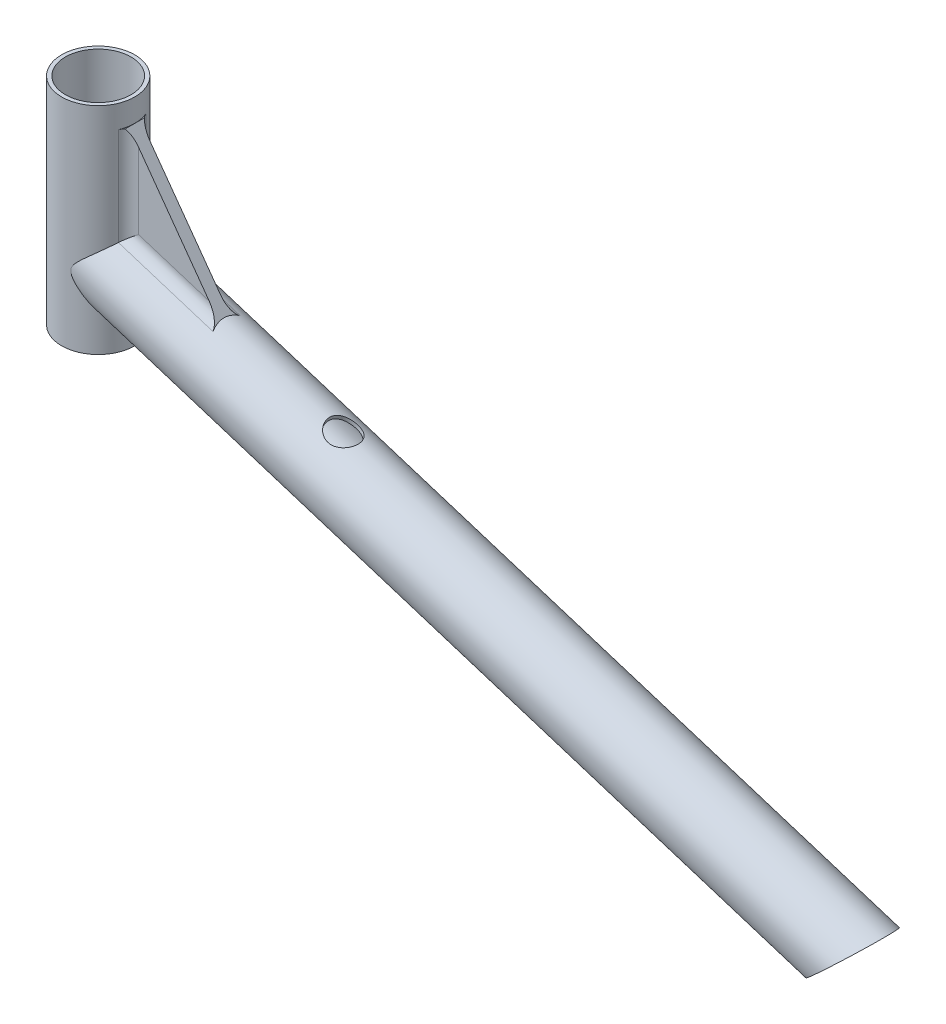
ISO-10303-21;
HEADER;
FILE_DESCRIPTION(('STEP AP214'),'2;1');
FILE_NAME('part.step','',(''),(''),'','','');
FILE_SCHEMA(('AUTOMOTIVE_DESIGN { 1 0 10303 214 1 1 1 1 }'));
ENDSEC;
DATA;
#1=APPLICATION_CONTEXT('core data for automotive mechanical design processes');
#2=APPLICATION_PROTOCOL_DEFINITION('international standard','automotive_design',2000,#1);
#3=PRODUCT_CONTEXT('',#1,'mechanical');
#4=PRODUCT('Part','Part','',(#3));
#5=PRODUCT_RELATED_PRODUCT_CATEGORY('part','',(#4));
#6=PRODUCT_DEFINITION_FORMATION('','',#4);
#7=PRODUCT_DEFINITION_CONTEXT('part definition',#1,'design');
#8=PRODUCT_DEFINITION('design','',#6,#7);
#9=PRODUCT_DEFINITION_SHAPE('','',#8);
#10=(LENGTH_UNIT() NAMED_UNIT(*) SI_UNIT(.MILLI.,.METRE.));
#11=(NAMED_UNIT(*) PLANE_ANGLE_UNIT() SI_UNIT($,.RADIAN.));
#12=(NAMED_UNIT(*) SI_UNIT($,.STERADIAN.) SOLID_ANGLE_UNIT());
#13=UNCERTAINTY_MEASURE_WITH_UNIT(LENGTH_MEASURE(1.E-05),#10,'distance_accuracy_value','');
#14=(GEOMETRIC_REPRESENTATION_CONTEXT(3) GLOBAL_UNCERTAINTY_ASSIGNED_CONTEXT((#13)) GLOBAL_UNIT_ASSIGNED_CONTEXT((#10,
#11,#12)) REPRESENTATION_CONTEXT('',''));
#15=CARTESIAN_POINT('',(0.,0.,0.));
#16=DIRECTION('',(0.,0.,1.));
#17=DIRECTION('',(1.,0.,0.));
#18=AXIS2_PLACEMENT_3D('',#15,#16,#17);
#19=CARTESIAN_POINT('',(0.,115.,0.));
#20=DIRECTION('',(0.,-1.,0.));
#21=DIRECTION('',(0.,0.,-1.));
#22=AXIS2_PLACEMENT_3D('',#19,#20,#21);
#23=CYLINDRICAL_SURFACE('',#22,17.5);
#24=CARTESIAN_POINT('',(0.,115.,0.));
#25=DIRECTION('',(0.,1.,0.));
#26=DIRECTION('',(0.,0.,1.));
#27=AXIS2_PLACEMENT_3D('',#24,#25,#26);
#28=CIRCLE('',#27,17.5);
#29=CARTESIAN_POINT('',(0.,115.,17.5));
#30=VERTEX_POINT('',#29);
#31=EDGE_CURVE('E217',#30,#30,#28,.T.);
#32=ORIENTED_EDGE('',*,*,#31,.T.);
#33=EDGE_LOOP('',(#32));
#34=FACE_BOUND('',#33,.T.);
#35=CARTESIAN_POINT('',(0.,0.,0.));
#36=DIRECTION('',(0.,1.,0.));
#37=DIRECTION('',(0.,0.,1.));
#38=AXIS2_PLACEMENT_3D('',#35,#36,#37);
#39=CIRCLE('',#38,17.5);
#40=CARTESIAN_POINT('',(0.,0.,17.5));
#41=VERTEX_POINT('',#40);
#42=EDGE_CURVE('E221',#41,#41,#39,.T.);
#43=ORIENTED_EDGE('',*,*,#42,.F.);
#44=EDGE_LOOP('',(#43));
#45=FACE_BOUND('',#44,.T.);
#46=CARTESIAN_POINT('',(17.5,14.657276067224,0.));
#47=CARTESIAN_POINT('',(17.4999970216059,14.6572801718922,-0.347708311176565));
#48=CARTESIAN_POINT('',(17.489607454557,14.6717695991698,-0.695461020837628));
#49=CARTESIAN_POINT('',(17.448362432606,14.7292974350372,-1.38738803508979));
#50=CARTESIAN_POINT('',(17.4175032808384,14.7723410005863,-1.73156168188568));
#51=CARTESIAN_POINT('',(17.3361911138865,14.8857816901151,-2.41340226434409));
#52=CARTESIAN_POINT('',(17.2857149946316,14.9562110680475,-2.75106103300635));
#53=CARTESIAN_POINT('',(17.1665524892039,15.1225263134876,-3.41669911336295));
#54=CARTESIAN_POINT('',(17.0978660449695,15.2184122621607,-3.74467839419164));
#55=CARTESIAN_POINT('',(16.9447697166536,15.4322129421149,-4.38544842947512));
#56=CARTESIAN_POINT('',(16.8605352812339,15.5498819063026,-4.69836383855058));
#57=CARTESIAN_POINT('',(16.6775485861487,15.805614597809,-5.31147784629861));
#58=CARTESIAN_POINT('',(16.5787893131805,15.9436881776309,-5.61167021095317));
#59=CARTESIAN_POINT('',(16.3684877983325,16.2378642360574,-6.19836496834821));
#60=CARTESIAN_POINT('',(16.25694596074,16.3939661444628,-6.48486779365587));
#61=CARTESIAN_POINT('',(16.022710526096,16.7219824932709,-7.04376026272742));
#62=CARTESIAN_POINT('',(15.9000189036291,16.8938941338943,-7.31615239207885));
#63=CARTESIAN_POINT('',(15.5729197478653,17.3525483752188,-7.99664440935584));
#64=CARTESIAN_POINT('',(15.3614610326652,17.6493588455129,-8.39460975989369));
#65=CARTESIAN_POINT('',(14.919532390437,18.2705576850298,-9.15706929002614));
#66=CARTESIAN_POINT('',(14.6890527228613,18.5949601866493,-9.52154611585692));
#67=CARTESIAN_POINT('',(14.2123806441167,19.2670748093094,-10.2194556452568));
#68=CARTESIAN_POINT('',(13.9661466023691,19.6148488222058,-10.5527998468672));
#69=CARTESIAN_POINT('',(13.4617393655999,20.3288346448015,-11.1891198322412));
#70=CARTESIAN_POINT('',(13.2035669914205,20.6950451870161,-11.4920976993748));
#71=CARTESIAN_POINT('',(12.7286222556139,21.370605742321,-12.0138007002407));
#72=CARTESIAN_POINT('',(12.5134771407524,21.6772877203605,-12.2375005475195));
#73=CARTESIAN_POINT('',(12.0782178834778,22.2994050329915,-12.6672888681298));
#74=CARTESIAN_POINT('',(11.8581031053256,22.6148414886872,-12.8733750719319));
#75=CARTESIAN_POINT('',(11.4138432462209,23.2535826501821,-13.2688611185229));
#76=CARTESIAN_POINT('',(11.1896957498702,23.5768921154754,-13.4582505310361));
#77=CARTESIAN_POINT('',(10.738479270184,24.2303715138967,-13.820956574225));
#78=CARTESIAN_POINT('',(10.5114104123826,24.5605411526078,-13.9942738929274));
#79=CARTESIAN_POINT('',(10.0555469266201,25.2267717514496,-14.3253353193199));
#80=CARTESIAN_POINT('',(9.82675455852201,25.5628255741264,-14.4830969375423));
#81=CARTESIAN_POINT('',(9.36816044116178,26.2407977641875,-14.7838680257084));
#82=CARTESIAN_POINT('',(9.1383586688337,26.5827162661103,-14.9268771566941));
#83=CARTESIAN_POINT('',(8.67896703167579,27.2720392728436,-15.1985756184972));
#84=CARTESIAN_POINT('',(8.44937711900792,27.6194407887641,-15.3272724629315));
#85=CARTESIAN_POINT('',(7.99162160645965,28.3199388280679,-15.5708433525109));
#86=CARTESIAN_POINT('',(7.76345588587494,28.6730348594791,-15.6857185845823));
#87=CARTESIAN_POINT('',(7.36119525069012,29.3053276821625,-15.877679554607));
#88=CARTESIAN_POINT('',(7.18646731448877,29.5833077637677,-15.9574575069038));
#89=CARTESIAN_POINT('',(6.84004333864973,30.1433125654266,-16.1089891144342));
#90=CARTESIAN_POINT('',(6.66834720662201,30.425337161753,-16.1807430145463));
#91=CARTESIAN_POINT('',(6.3292389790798,30.9945388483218,-16.3163761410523));
#92=CARTESIAN_POINT('',(6.16183503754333,31.2817242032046,-16.3802411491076));
#93=CARTESIAN_POINT('',(5.83393252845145,31.8616464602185,-16.499867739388));
#94=CARTESIAN_POINT('',(5.67343283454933,32.1543824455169,-16.5556306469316));
#95=CARTESIAN_POINT('',(5.39165839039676,32.6919706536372,-16.6492585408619));
#96=CARTESIAN_POINT('',(5.26862404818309,32.9356507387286,-16.6885256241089));
#97=CARTESIAN_POINT('',(5.03244014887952,33.4288432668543,-16.7612587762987));
#98=CARTESIAN_POINT('',(4.91929638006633,33.6783590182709,-16.7947214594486));
#99=CARTESIAN_POINT('',(4.70788049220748,34.1835677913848,-16.855203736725));
#100=CARTESIAN_POINT('',(4.6095631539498,34.4392391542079,-16.8822430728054));
#101=CARTESIAN_POINT('',(4.43456163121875,34.9583852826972,-16.9290539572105));
#102=CARTESIAN_POINT('',(4.35784675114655,35.2218483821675,-16.9488358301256));
#103=CARTESIAN_POINT('',(4.23760868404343,35.751292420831,-16.9792962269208));
#104=CARTESIAN_POINT('',(4.19341648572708,36.0171016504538,-16.9901588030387));
#105=CARTESIAN_POINT('',(4.14822320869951,36.5522173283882,-17.001267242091));
#106=CARTESIAN_POINT('',(4.1470367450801,36.8215037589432,-17.0015586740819));
#107=CARTESIAN_POINT('',(4.18322651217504,37.2228064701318,-16.9926637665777));
#108=CARTESIAN_POINT('',(4.20180080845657,37.3567753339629,-16.9880985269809));
#109=CARTESIAN_POINT('',(4.25156136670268,37.6222201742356,-16.9757155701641));
#110=CARTESIAN_POINT('',(4.28274787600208,37.7536961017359,-16.9678977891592));
#111=CARTESIAN_POINT('',(4.35696877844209,38.0133686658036,-16.9489902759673));
#112=CARTESIAN_POINT('',(4.40003484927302,38.141555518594,-16.9378917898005));
#113=CARTESIAN_POINT('',(4.49651974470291,38.3936706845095,-16.9125338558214));
#114=CARTESIAN_POINT('',(4.5499434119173,38.5175969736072,-16.8982729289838));
#115=CARTESIAN_POINT('',(4.69168905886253,38.8161397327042,-16.8595845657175));
#116=CARTESIAN_POINT('',(4.78484588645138,38.9882376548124,-16.8334804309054));
#117=CARTESIAN_POINT('',(4.98467596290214,39.3233266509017,-16.7753940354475));
#118=CARTESIAN_POINT('',(5.0913583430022,39.4863114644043,-16.7434077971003));
#119=CARTESIAN_POINT('',(5.31477844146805,39.8048149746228,-16.6738380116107));
#120=CARTESIAN_POINT('',(5.43155120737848,39.9603044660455,-16.6362345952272));
#121=CARTESIAN_POINT('',(5.67195621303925,40.2643679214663,-16.5558144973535));
#122=CARTESIAN_POINT('',(5.7955871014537,40.4129432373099,-16.5129988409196));
#123=CARTESIAN_POINT('',(6.06685369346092,40.7264593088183,-16.4154525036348));
#124=CARTESIAN_POINT('',(6.21528182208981,40.8904550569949,-16.3598999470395));
#125=CARTESIAN_POINT('',(6.51639898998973,41.212111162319,-16.2423132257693));
#126=CARTESIAN_POINT('',(6.66908901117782,41.3697700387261,-16.1802775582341));
#127=CARTESIAN_POINT('',(7.13134887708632,41.8350056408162,-15.9845425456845));
#128=CARTESIAN_POINT('',(7.44491724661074,42.1346283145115,-15.8412827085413));
#129=CARTESIAN_POINT('',(8.07472581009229,42.717752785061,-15.5297338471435));
#130=CARTESIAN_POINT('',(8.39096717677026,43.001247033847,-15.3614332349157));
#131=CARTESIAN_POINT('',(9.021150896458,43.5543760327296,-15.0000249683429));
#132=CARTESIAN_POINT('',(9.33509400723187,43.8240155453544,-14.8069259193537));
#133=CARTESIAN_POINT('',(10.0194666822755,44.4032885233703,-14.354804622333));
#134=CARTESIAN_POINT('',(10.3886512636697,44.7101503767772,-14.090319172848));
#135=CARTESIAN_POINT('',(11.1140279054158,45.3060169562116,-13.525523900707));
#136=CARTESIAN_POINT('',(11.4702168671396,45.5950174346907,-13.2252056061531));
#137=CARTESIAN_POINT('',(12.1647566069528,46.1538938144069,-12.5892870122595));
#138=CARTESIAN_POINT('',(12.503127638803,46.4237915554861,-12.2537281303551));
#139=CARTESIAN_POINT('',(13.1583159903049,46.943285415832,-11.5473287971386));
#140=CARTESIAN_POINT('',(13.4751278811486,47.1928764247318,-11.1764795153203));
#141=CARTESIAN_POINT('',(14.035762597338,47.6326224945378,-10.4604492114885));
#142=CARTESIAN_POINT('',(14.2833004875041,47.8260030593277,-10.1201524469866));
#143=CARTESIAN_POINT('',(14.7569505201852,48.19495259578,-9.41606575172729));
#144=CARTESIAN_POINT('',(14.9830743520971,48.3705312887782,-9.05228882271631));
#145=CARTESIAN_POINT('',(15.4112869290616,48.7022789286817,-8.3023302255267));
#146=CARTESIAN_POINT('',(15.6133739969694,48.8584465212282,-7.91614699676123));
#147=CARTESIAN_POINT('',(15.9907275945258,49.1495516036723,-7.12316025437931));
#148=CARTESIAN_POINT('',(16.165993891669,49.2844889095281,-6.71635656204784));
#149=CARTESIAN_POINT('',(16.4881853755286,49.5322214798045,-5.88144429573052));
#150=CARTESIAN_POINT('',(16.6348953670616,49.6448487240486,-5.45320238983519));
#151=CARTESIAN_POINT('',(16.8958534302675,49.8449946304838,-4.58118274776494));
#152=CARTESIAN_POINT('',(17.0101010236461,49.9325129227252,-4.1374047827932));
#153=CARTESIAN_POINT('',(17.2039273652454,50.0809004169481,-3.23824851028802));
#154=CARTESIAN_POINT('',(17.2835279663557,50.1417864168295,-2.78287770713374));
#155=CARTESIAN_POINT('',(17.4065595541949,50.2358623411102,-1.86446861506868));
#156=CARTESIAN_POINT('',(17.4499954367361,50.2690560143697,-1.40143137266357));
#157=CARTESIAN_POINT('',(17.4967556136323,50.3047881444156,-0.529327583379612));
#158=CARTESIAN_POINT('',(17.5043503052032,50.3105902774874,-0.120615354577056));
#159=CARTESIAN_POINT('',(17.4909191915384,50.3003279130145,0.696039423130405));
#160=CARTESIAN_POINT('',(17.4698961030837,50.2842654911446,1.10398204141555));
#161=CARTESIAN_POINT('',(17.3995790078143,50.2305213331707,1.9159029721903));
#162=CARTESIAN_POINT('',(17.3502897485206,50.1928432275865,2.31988193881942));
#163=CARTESIAN_POINT('',(17.2242258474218,50.0964209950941,3.12097013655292));
#164=CARTESIAN_POINT('',(17.1474509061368,50.0376766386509,3.51807929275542));
#165=CARTESIAN_POINT('',(16.9706900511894,49.9023190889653,4.28913841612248));
#166=CARTESIAN_POINT('',(16.8715962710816,49.8263922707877,4.66341472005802));
#167=CARTESIAN_POINT('',(16.6502026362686,49.6565867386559,5.40082881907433));
#168=CARTESIAN_POINT('',(16.5279036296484,49.5627086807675,5.7639670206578));
#169=CARTESIAN_POINT('',(16.2616036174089,49.3580339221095,6.47728350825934));
#170=CARTESIAN_POINT('',(16.1176013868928,49.2472362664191,6.82746106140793));
#171=CARTESIAN_POINT('',(15.8095249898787,49.0098240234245,7.51334091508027));
#172=CARTESIAN_POINT('',(15.6454484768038,48.8832075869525,7.84904151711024));
#173=CARTESIAN_POINT('',(15.2833707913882,48.6032564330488,8.53415856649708));
#174=CARTESIAN_POINT('',(15.0836464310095,48.4485435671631,8.8821009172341));
#175=CARTESIAN_POINT('',(14.6646122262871,48.1230948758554,9.55810262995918));
#176=CARTESIAN_POINT('',(14.4453013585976,47.9523582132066,9.88616095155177));
#177=CARTESIAN_POINT('',(13.9891890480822,47.5961098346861,10.5216746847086));
#178=CARTESIAN_POINT('',(13.7523795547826,47.4105913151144,10.8291204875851));
#179=CARTESIAN_POINT('',(13.263487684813,47.0260242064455,11.4226865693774));
#180=CARTESIAN_POINT('',(13.0114033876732,46.8269739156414,11.708804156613));
#181=CARTESIAN_POINT('',(12.450591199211,46.3818643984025,12.3055842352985));
#182=CARTESIAN_POINT('',(12.1394621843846,46.1335257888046,12.6122944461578));
#183=CARTESIAN_POINT('',(11.5026199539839,45.6211054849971,13.1956878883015));
#184=CARTESIAN_POINT('',(11.176909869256,45.3570271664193,13.4723775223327));
#185=CARTESIAN_POINT('',(10.5141057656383,44.8136915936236,13.9957829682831));
#186=CARTESIAN_POINT('',(10.1770086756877,44.5344302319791,14.2424906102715));
#187=CARTESIAN_POINT('',(9.49522205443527,43.9607938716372,14.7057967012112));
#188=CARTESIAN_POINT('',(9.15053435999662,43.6664225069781,14.9224023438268));
#189=CARTESIAN_POINT('',(8.57673355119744,43.1649804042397,15.2564434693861));
#190=CARTESIAN_POINT('',(8.34848876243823,42.9625584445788,15.3824279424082));
#191=CARTESIAN_POINT('',(7.89231177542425,42.5497713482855,15.6213846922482));
#192=CARTESIAN_POINT('',(7.66437959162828,42.3394058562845,15.7343563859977));
#193=CARTESIAN_POINT('',(7.2112530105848,41.9095503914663,15.9471138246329));
#194=CARTESIAN_POINT('',(6.98605706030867,41.6900659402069,16.0469074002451));
#195=CARTESIAN_POINT('',(6.5415812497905,41.2397662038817,16.2331638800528));
#196=CARTESIAN_POINT('',(6.3222993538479,41.0089548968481,16.319631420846));
#197=CARTESIAN_POINT('',(5.98921549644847,40.6376653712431,16.4437106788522));
#198=CARTESIAN_POINT('',(5.87154209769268,40.5022374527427,16.4860518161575));
#199=CARTESIAN_POINT('',(5.64114341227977,40.225986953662,16.5663016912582));
#200=CARTESIAN_POINT('',(5.52841704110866,40.085165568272,16.6042114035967));
#201=CARTESIAN_POINT('',(5.30980502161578,39.7972361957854,16.6754061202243));
#202=CARTESIAN_POINT('',(5.20391608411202,39.6501312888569,16.7086933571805));
#203=CARTESIAN_POINT('',(5.0015338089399,39.3486697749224,16.7703865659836));
#204=CARTESIAN_POINT('',(4.90503701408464,39.19431586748,16.7987943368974));
#205=CARTESIAN_POINT('',(4.68656333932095,38.8103611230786,16.8613112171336));
#206=CARTESIAN_POINT('',(4.57103195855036,38.5765073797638,16.892762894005));
#207=CARTESIAN_POINT('',(4.3779583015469,38.0927851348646,16.9438381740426));
#208=CARTESIAN_POINT('',(4.30028741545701,37.8429741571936,16.9635018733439));
#209=CARTESIAN_POINT('',(4.19186485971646,37.3305375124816,16.9906341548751));
#210=CARTESIAN_POINT('',(4.1614729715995,37.0678291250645,16.998009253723));
#211=CARTESIAN_POINT('',(4.14801502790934,36.5409456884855,17.0012908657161));
#212=CARTESIAN_POINT('',(4.16505532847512,36.2767686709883,16.9971716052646));
#213=CARTESIAN_POINT('',(4.22761140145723,35.8187712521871,16.981694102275));
#214=CARTESIAN_POINT('',(4.26508683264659,35.6236367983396,16.9723669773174));
#215=CARTESIAN_POINT('',(4.35636920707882,35.2374236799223,16.9491674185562));
#216=CARTESIAN_POINT('',(4.41018824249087,35.0463481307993,16.9352916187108));
#217=CARTESIAN_POINT('',(4.53037226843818,34.6676344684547,16.903537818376));
#218=CARTESIAN_POINT('',(4.59679451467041,34.4800165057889,16.8856414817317));
#219=CARTESIAN_POINT('',(4.7388877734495,34.1088139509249,16.8463171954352));
#220=CARTESIAN_POINT('',(4.81455583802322,33.9252280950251,16.8248903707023));
#221=CARTESIAN_POINT('',(5.04172565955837,33.4030814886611,16.7587173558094));
#222=CARTESIAN_POINT('',(5.20187288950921,33.0688156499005,16.7099154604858));
#223=CARTESIAN_POINT('',(5.5367489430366,32.4093008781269,16.6019743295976));
#224=CARTESIAN_POINT('',(5.71148770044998,32.0840582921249,16.5428280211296));
#225=CARTESIAN_POINT('',(6.0704874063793,31.440079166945,16.4144938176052));
#226=CARTESIAN_POINT('',(6.25476597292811,31.1213563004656,16.3452868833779));
#227=CARTESIAN_POINT('',(6.62920785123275,30.4896994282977,16.1970427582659));
#228=CARTESIAN_POINT('',(6.81937164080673,30.1767658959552,16.1180047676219));
#229=CARTESIAN_POINT('',(7.20393724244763,29.5550305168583,15.9498421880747));
#230=CARTESIAN_POINT('',(7.39834914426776,29.2462421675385,15.8606908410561));
#231=CARTESIAN_POINT('',(7.78941211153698,28.6331564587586,15.6723380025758));
#232=CARTESIAN_POINT('',(7.98606332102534,28.3288593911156,15.5731358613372));
#233=CARTESIAN_POINT('',(8.38024669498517,27.7248880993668,15.3646064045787));
#234=CARTESIAN_POINT('',(8.57777752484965,27.4252087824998,15.2552913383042));
#235=CARTESIAN_POINT('',(8.97308568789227,26.8300461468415,15.0261749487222));
#236=CARTESIAN_POINT('',(9.1708630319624,26.5345630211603,14.9063731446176));
#237=CARTESIAN_POINT('',(9.76220121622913,25.6563622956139,14.5315799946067));
#238=CARTESIAN_POINT('',(10.1550697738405,25.0799142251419,14.2605213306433));
#239=CARTESIAN_POINT('',(10.9340727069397,23.9456787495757,13.6723995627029));
#240=CARTESIAN_POINT('',(11.3202037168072,23.3879005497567,13.3553141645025));
#241=CARTESIAN_POINT('',(12.0794120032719,22.297021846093,12.672708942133));
#242=CARTESIAN_POINT('',(12.4525307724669,21.7638407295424,12.3073651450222));
#243=CARTESIAN_POINT('',(13.1815402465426,20.7260047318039,11.5231699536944));
#244=CARTESIAN_POINT('',(13.5374429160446,20.2213299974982,11.1043564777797));
#245=CARTESIAN_POINT('',(14.0770885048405,19.4581838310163,10.4013862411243));
#246=CARTESIAN_POINT('',(14.2689777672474,19.187265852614,10.1368935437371));
#247=CARTESIAN_POINT('',(14.6434233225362,18.6593046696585,9.58804151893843));
#248=CARTESIAN_POINT('',(14.8259791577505,18.4022621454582,9.30368121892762));
#249=CARTESIAN_POINT('',(15.1798250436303,17.9045875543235,8.71441285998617));
#250=CARTESIAN_POINT('',(15.3511178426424,17.6639514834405,8.4095098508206));
#251=CARTESIAN_POINT('',(15.6802924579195,17.2019412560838,7.77849727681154));
#252=CARTESIAN_POINT('',(15.8381750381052,16.9805660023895,7.45238892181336));
#253=CARTESIAN_POINT('',(16.1137123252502,16.5945094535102,6.83328388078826));
#254=CARTESIAN_POINT('',(16.2337443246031,16.4264482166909,6.54345585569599));
#255=CARTESIAN_POINT('',(16.4608225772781,16.1086746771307,5.94915376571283));
#256=CARTESIAN_POINT('',(16.5678751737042,15.9589534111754,5.6446869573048));
#257=CARTESIAN_POINT('',(16.7671181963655,15.6804155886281,5.02200030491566));
#258=CARTESIAN_POINT('',(16.8593237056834,15.551577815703,4.70379484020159));
#259=CARTESIAN_POINT('',(17.0270999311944,15.3172236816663,4.05464641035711));
#260=CARTESIAN_POINT('',(17.1026741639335,15.2117023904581,3.72370615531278));
#261=CARTESIAN_POINT('',(17.2227646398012,15.0440653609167,3.11504220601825));
#262=CARTESIAN_POINT('',(17.2704538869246,14.9775115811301,2.83916102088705));
#263=CARTESIAN_POINT('',(17.3528930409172,14.8624782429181,2.28176150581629));
#264=CARTESIAN_POINT('',(17.387644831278,14.81399605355,2.00024400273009));
#265=CARTESIAN_POINT('',(17.4435290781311,14.7360386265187,1.43331451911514));
#266=CARTESIAN_POINT('',(17.4646652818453,14.7065581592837,1.14790363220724));
#267=CARTESIAN_POINT('',(17.4929030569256,14.6671736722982,0.575005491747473));
#268=CARTESIAN_POINT('',(17.5000024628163,14.6572726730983,0.287517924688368));
#269=CARTESIAN_POINT('',(17.5,14.657276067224,0.));
#270=B_SPLINE_CURVE_WITH_KNOTS('',3,(#46,#47,#48,#49,#50,#51,#52,#53,#54,#55,#56,#57,#58,#59,
#60,#61,#62,#63,#64,#65,#66,#67,#68,#69,#70,#71,#72,#73,#74,#75,#76,#77,#78,#79,#80,#81,#82,#83,
#84,#85,#86,#87,#88,#89,#90,#91,#92,#93,#94,#95,#96,#97,#98,#99,#100,#101,#102,#103,#104,#105,
#106,#107,#108,#109,#110,#111,#112,#113,#114,#115,#116,#117,#118,#119,#120,#121,#122,#123,#124,
#125,#126,#127,#128,#129,#130,#131,#132,#133,#134,#135,#136,#137,#138,#139,#140,#141,#142,#143,
#144,#145,#146,#147,#148,#149,#150,#151,#152,#153,#154,#155,#156,#157,#158,#159,#160,#161,#162,
#163,#164,#165,#166,#167,#168,#169,#170,#171,#172,#173,#174,#175,#176,#177,#178,#179,#180,#181,
#182,#183,#184,#185,#186,#187,#188,#189,#190,#191,#192,#193,#194,#195,#196,#197,#198,#199,#200,
#201,#202,#203,#204,#205,#206,#207,#208,#209,#210,#211,#212,#213,#214,#215,#216,#217,#218,#219,
#220,#221,#222,#223,#224,#225,#226,#227,#228,#229,#230,#231,#232,#233,#234,#235,#236,#237,#238,
#239,#240,#241,#242,#243,#244,#245,#246,#247,#248,#249,#250,#251,#252,#253,#254,#255,#256,#257,
#258,#259,#260,#261,#262,#263,#264,#265,#266,#267,#268,#269),.UNSPECIFIED.,.T.,.F.,(4,2,2,2,2,2,
2,2,2,2,2,2,2,2,2,2,2,2,2,2,2,2,2,2,2,2,2,2,2,2,2,2,2,2,2,2,2,2,2,2,2,2,2,2,2,2,2,2,2,2,2,2,2,2,
2,2,2,2,2,2,2,2,2,2,2,2,2,2,2,2,2,2,2,2,2,2,2,2,2,2,2,2,2,2,2,2,2,2,2,2,2,2,2,2,2,2,2,2,2,2,2,2,
2,2,2,2,2,2,2,2,2,4),(0.,1.04275249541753,2.0856933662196,3.12986631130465,4.1740425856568,
5.20708602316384,6.2406299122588,7.27414112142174,8.30746965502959,9.92375727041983,
11.5408777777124,13.1624636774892,14.7839382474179,16.092446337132,17.401122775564,
18.7106110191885,20.020043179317,21.327984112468,22.6359550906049,23.9432361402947,
25.2504048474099,26.2639449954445,27.2774542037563,28.2927642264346,29.3079079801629,
30.1350530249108,30.9626789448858,31.787727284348,32.6115973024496,33.4180060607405,
34.2209382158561,34.626330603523,35.03173094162,35.4382229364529,35.8449054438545,
36.436147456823,37.0277907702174,37.6215787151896,38.2152500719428,38.8991568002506,
39.5832224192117,40.952233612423,42.321880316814,43.6910530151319,45.3337537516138,
46.9768436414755,48.6180236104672,50.2596153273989,51.6476228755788,53.0348683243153,
54.422210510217,55.8095647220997,57.2070001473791,58.6044561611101,60.0010294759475,
61.3974136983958,62.6223361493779,63.8471423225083,65.0717428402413,66.2963567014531,
67.4787225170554,68.6610451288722,69.8434344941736,71.0259622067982,72.3146472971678,
73.6033997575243,74.8927488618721,76.1822604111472,77.6884178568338,79.1942534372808,
80.7004984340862,82.206382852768,83.196269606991,84.1862006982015,85.1755408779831,
86.1645360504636,86.7173950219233,87.2701321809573,87.8226014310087,88.3748665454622,
89.1603212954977,89.9430889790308,90.7317846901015,91.5222502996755,92.1181720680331,
92.7145358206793,93.3136766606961,93.9126269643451,95.0332712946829,96.1546848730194,
97.278248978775,98.4019045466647,99.528605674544,100.655379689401,101.780806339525,
102.906284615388,105.149860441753,107.394526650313,109.631220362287,111.866336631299,
113.139087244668,114.411900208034,115.684401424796,116.956830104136,118.023575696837,
119.089797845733,120.154929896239,121.219836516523,122.082312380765,122.944662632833,
123.806775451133,124.669021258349),.UNSPECIFIED.);
#271=CARTESIAN_POINT('',(17.5,14.657276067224,0.));
#272=VERTEX_POINT('',#271);
#273=EDGE_CURVE('E139',#272,#272,#270,.T.);
#274=ORIENTED_EDGE('',*,*,#273,.T.);
#275=EDGE_LOOP('',(#274));
#276=FACE_BOUND('',#275,.T.);
#277=CARTESIAN_POINT('',(0.,1197.03445029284,0.));
#278=DIRECTION('',(0.999873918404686,0.0158791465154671,0.));
#279=DIRECTION('',(0.0158791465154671,-0.999873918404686,0.));
#280=AXIS2_PLACEMENT_3D('',#277,#278,#279);
#281=ELLIPSE('',#280,1102.07434530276,17.5);
#282=CARTESIAN_POINT('',(17.3779406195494,102.784859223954,2.06329344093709));
#283=VERTEX_POINT('',#282);
#284=CARTESIAN_POINT('',(17.3779406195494,102.784859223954,-2.06329344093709));
#285=VERTEX_POINT('',#284);
#286=EDGE_CURVE('E110',#283,#285,#281,.T.);
#287=ORIENTED_EDGE('',*,*,#286,.T.);
#288=CARTESIAN_POINT('',(0.,102.784859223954,0.));
#289=DIRECTION('',(0.,-1.,0.));
#290=DIRECTION('',(0.,0.,-1.));
#291=AXIS2_PLACEMENT_3D('',#288,#289,#290);
#292=CIRCLE('',#291,17.5);
#293=EDGE_CURVE('E122',#285,#283,#292,.T.);
#294=ORIENTED_EDGE('',*,*,#293,.T.);
#295=EDGE_LOOP('',(#287,#294));
#296=FACE_BOUND('',#295,.T.);
#297=ADVANCED_FACE('F33',(#34,#45,#276,#296),#23,.F.);
#298=CARTESIAN_POINT('',(0.,115.,0.));
#299=DIRECTION('',(0.,-1.,0.));
#300=DIRECTION('',(0.,0.,-1.));
#301=AXIS2_PLACEMENT_3D('',#298,#299,#300);
#302=CYLINDRICAL_SURFACE('',#301,19.5);
#303=CARTESIAN_POINT('',(0.,115.,0.));
#304=DIRECTION('',(0.,1.,0.));
#305=DIRECTION('',(0.,0.,1.));
#306=AXIS2_PLACEMENT_3D('',#303,#304,#305);
#307=CIRCLE('',#306,19.5);
#308=CARTESIAN_POINT('',(0.,115.,19.5));
#309=VERTEX_POINT('',#308);
#310=EDGE_CURVE('E216',#309,#309,#307,.T.);
#311=ORIENTED_EDGE('',*,*,#310,.F.);
#312=EDGE_LOOP('',(#311));
#313=FACE_BOUND('',#312,.T.);
#314=CARTESIAN_POINT('',(0.,0.,0.));
#315=DIRECTION('',(0.,1.,0.));
#316=DIRECTION('',(0.,0.,1.));
#317=AXIS2_PLACEMENT_3D('',#314,#315,#316);
#318=CIRCLE('',#317,19.5);
#319=CARTESIAN_POINT('',(0.,0.,19.5));
#320=VERTEX_POINT('',#319);
#321=EDGE_CURVE('E220',#320,#320,#318,.T.);
#322=ORIENTED_EDGE('',*,*,#321,.T.);
#323=EDGE_LOOP('',(#322));
#324=FACE_BOUND('',#323,.T.);
#325=CARTESIAN_POINT('',(0.,102.784859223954,0.));
#326=DIRECTION('',(0.,-1.,0.));
#327=DIRECTION('',(0.,0.,-1.));
#328=AXIS2_PLACEMENT_3D('',#325,#326,#327);
#329=CIRCLE('',#328,19.5);
#330=CARTESIAN_POINT('',(18.0583115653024,102.784859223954,-7.35849056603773));
#331=VERTEX_POINT('',#330);
#332=CARTESIAN_POINT('',(19.5,102.784859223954,0.));
#333=VERTEX_POINT('',#332);
#334=EDGE_CURVE('E168',#331,#333,#329,.T.);
#335=ORIENTED_EDGE('',*,*,#334,.F.);
#336=DIRECTION('',(0.,-1.,0.));
#337=VECTOR('',#336,1.);
#338=CARTESIAN_POINT('',(18.0583115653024,115.,-7.35849056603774));
#339=LINE('',#338,#337);
#340=CARTESIAN_POINT('',(18.0583115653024,50.6735402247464,-7.35849056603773));
#341=VERTEX_POINT('',#340);
#342=EDGE_CURVE('E267',#331,#341,#339,.T.);
#343=ORIENTED_EDGE('',*,*,#342,.T.);
#344=CARTESIAN_POINT('',(19.5,11.9296202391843,0.));
#345=CARTESIAN_POINT('',(19.5000020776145,11.9296173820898,-0.388079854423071));
#346=CARTESIAN_POINT('',(19.4883858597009,11.9457798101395,-0.776134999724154));
#347=CARTESIAN_POINT('',(19.4422774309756,12.0099407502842,-1.54839845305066));
#348=CARTESIAN_POINT('',(19.4077747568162,12.0579538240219,-1.93260491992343));
#349=CARTESIAN_POINT('',(19.316825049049,12.184540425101,-2.69398891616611));
#350=CARTESIAN_POINT('',(19.2603379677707,12.2631697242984,-3.07115229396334));
#351=CARTESIAN_POINT('',(19.1269780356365,12.4488528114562,-3.814627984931));
#352=CARTESIAN_POINT('',(19.0501064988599,12.5559047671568,-4.18094099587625));
#353=CARTESIAN_POINT('',(18.8787556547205,12.7946084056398,-4.89658240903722));
#354=CARTESIAN_POINT('',(18.7844737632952,12.9259843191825,-5.24605070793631));
#355=CARTESIAN_POINT('',(18.5797271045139,13.2114006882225,-5.93055403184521));
#356=CARTESIAN_POINT('',(18.4692624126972,13.3654410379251,-6.265589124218));
#357=CARTESIAN_POINT('',(18.11642981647,13.8576925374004,-7.24764806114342));
#358=CARTESIAN_POINT('',(17.8525152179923,14.2261846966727,-7.87206082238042));
#359=CARTESIAN_POINT('',(17.34369669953,14.9375867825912,-8.9281401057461));
#360=CARTESIAN_POINT('',(17.1071429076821,15.2686286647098,-9.37219019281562));
#361=CARTESIAN_POINT('',(16.6126331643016,15.9615565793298,-10.2231332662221));
#362=CARTESIAN_POINT('',(16.3546662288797,16.323458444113,-10.6300069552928));
#363=CARTESIAN_POINT('',(15.8211071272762,17.07318226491,-11.4090404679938));
#364=CARTESIAN_POINT('',(15.5454678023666,17.461073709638,-11.7811002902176));
#365=CARTESIAN_POINT('',(14.9807381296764,18.2573603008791,-12.4913275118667));
#366=CARTESIAN_POINT('',(14.6916486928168,18.6657540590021,-12.8294972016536));
#367=CARTESIAN_POINT('',(14.1594337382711,19.4194733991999,-13.4121125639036));
#368=CARTESIAN_POINT('',(13.9181400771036,19.761853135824,-13.6620869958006));
#369=CARTESIAN_POINT('',(13.4298854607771,20.4563279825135,-14.1423281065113));
#370=CARTESIAN_POINT('',(13.1829237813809,20.8084243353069,-14.3725922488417));
#371=CARTESIAN_POINT('',(12.684364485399,21.5213239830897,-14.8144493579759));
#372=CARTESIAN_POINT('',(12.4327641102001,21.8821325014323,-15.0260307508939));
#373=CARTESIAN_POINT('',(11.9261394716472,22.6113123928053,-15.4312149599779));
#374=CARTESIAN_POINT('',(11.671115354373,22.9796834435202,-15.6248185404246));
#375=CARTESIAN_POINT('',(11.1589812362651,23.7228284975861,-15.9945851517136));
#376=CARTESIAN_POINT('',(10.9018743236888,24.0975937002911,-16.1707701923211));
#377=CARTESIAN_POINT('',(10.3862880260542,24.853516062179,-16.5066554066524));
#378=CARTESIAN_POINT('',(10.1278086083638,25.2346733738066,-16.6663551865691));
#379=CARTESIAN_POINT('',(9.61076991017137,26.0029194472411,-16.9697640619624));
#380=CARTESIAN_POINT('',(9.35221074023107,26.3900050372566,-17.1134813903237));
#381=CARTESIAN_POINT('',(8.83626745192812,27.1702832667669,-17.3854933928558));
#382=CARTESIAN_POINT('',(8.57888323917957,27.5634754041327,-17.5137893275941));
#383=CARTESIAN_POINT('',(8.12448487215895,28.267433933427,-17.7282525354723));
#384=CARTESIAN_POINT('',(7.92687755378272,28.5769089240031,-17.8174149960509));
#385=CARTESIAN_POINT('',(7.53460808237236,29.2001366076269,-17.9868090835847));
#386=CARTESIAN_POINT('',(7.33994584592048,29.5138891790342,-18.0670409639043));
#387=CARTESIAN_POINT('',(6.95472445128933,30.1470004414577,-18.2188020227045));
#388=CARTESIAN_POINT('',(6.76417548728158,30.46637013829,-18.2903112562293));
#389=CARTESIAN_POINT('',(6.39000521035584,31.1109500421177,-18.4243660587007));
#390=CARTESIAN_POINT('',(6.20638263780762,31.4361591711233,-18.4869132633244));
#391=CARTESIAN_POINT('',(5.87620122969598,32.0451340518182,-18.5942401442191));
#392=CARTESIAN_POINT('',(5.72818735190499,32.3278837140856,-18.6402790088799));
#393=CARTESIAN_POINT('',(5.44331124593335,32.900302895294,-18.725448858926));
#394=CARTESIAN_POINT('',(5.30645733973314,33.1899773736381,-18.764574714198));
#395=CARTESIAN_POINT('',(5.05017710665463,33.7767367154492,-18.8351609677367));
#396=CARTESIAN_POINT('',(4.93068925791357,34.0737908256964,-18.8666487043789));
#397=CARTESIAN_POINT('',(4.71783597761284,34.6776171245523,-18.9209942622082));
#398=CARTESIAN_POINT('',(4.62442500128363,34.984371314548,-18.9438671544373));
#399=CARTESIAN_POINT('',(4.48423850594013,35.5820944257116,-18.9775284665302));
#400=CARTESIAN_POINT('',(4.43415767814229,35.8721695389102,-18.9891831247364));
#401=CARTESIAN_POINT('',(4.39500169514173,36.3101192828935,-18.9982652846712));
#402=CARTESIAN_POINT('',(4.38792461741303,36.4563111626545,-18.9998972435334));
#403=CARTESIAN_POINT('',(4.38708110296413,36.7487009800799,-19.0000932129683));
#404=CARTESIAN_POINT('',(4.39330687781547,36.8948988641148,-18.9986590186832));
#405=CARTESIAN_POINT('',(4.42000392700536,37.1873779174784,-18.9924656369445));
#406=CARTESIAN_POINT('',(4.44061407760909,37.3336458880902,-18.9876740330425));
#407=CARTESIAN_POINT('',(4.49608844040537,37.6232877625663,-18.9746144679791));
#408=CARTESIAN_POINT('',(4.53095306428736,37.7666615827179,-18.9663464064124));
#409=CARTESIAN_POINT('',(4.61396914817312,38.0497098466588,-18.9463216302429));
#410=CARTESIAN_POINT('',(4.6621615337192,38.1893714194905,-18.9345541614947));
#411=CARTESIAN_POINT('',(4.77006619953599,38.4638601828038,-18.9076587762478));
#412=CARTESIAN_POINT('',(4.82978433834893,38.5986848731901,-18.8925291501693));
#413=CARTESIAN_POINT('',(4.98770618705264,38.9225640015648,-18.8515795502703));
#414=CARTESIAN_POINT('',(5.09116012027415,39.1088285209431,-18.8240079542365));
#415=CARTESIAN_POINT('',(5.31267378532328,39.4713508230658,-18.7626950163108));
#416=CARTESIAN_POINT('',(5.43074325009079,39.6476018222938,-18.7289495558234));
#417=CARTESIAN_POINT('',(5.67769311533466,39.9920413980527,-18.6555745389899));
#418=CARTESIAN_POINT('',(5.80661316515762,40.1601965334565,-18.6159229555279));
#419=CARTESIAN_POINT('',(6.07176121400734,40.4890736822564,-18.5311391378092));
#420=CARTESIAN_POINT('',(6.20798770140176,40.6497972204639,-18.4860080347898));
#421=CARTESIAN_POINT('',(6.54559440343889,41.0332757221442,-18.3697937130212));
#422=CARTESIAN_POINT('',(6.74967588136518,41.252801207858,-18.295927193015));
#423=CARTESIAN_POINT('',(7.16407683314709,41.6820186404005,-18.1376766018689));
#424=CARTESIAN_POINT('',(7.37439870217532,41.8917067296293,-18.0532884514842));
#425=CARTESIAN_POINT('',(7.79872024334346,42.3032873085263,-17.8740891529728));
#426=CARTESIAN_POINT('',(8.01272399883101,42.5051702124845,-17.7792657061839));
#427=CARTESIAN_POINT('',(8.44226892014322,42.9021306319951,-17.5793712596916));
#428=CARTESIAN_POINT('',(8.65781028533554,43.0972072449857,-17.4742989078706));
#429=CARTESIAN_POINT('',(9.30507122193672,43.6739817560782,-17.1435202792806));
#430=CARTESIAN_POINT('',(9.73697394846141,44.0467946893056,-16.9024414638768));
#431=CARTESIAN_POINT('',(10.5928315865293,44.7717053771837,-16.3796709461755));
#432=CARTESIAN_POINT('',(11.0167914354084,45.1238163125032,-16.0980054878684));
#433=CARTESIAN_POINT('',(11.8626581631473,45.8175511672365,-15.4857082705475));
#434=CARTESIAN_POINT('',(12.2842027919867,46.1586379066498,-15.1539628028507));
#435=CARTESIAN_POINT('',(13.1078942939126,46.8192868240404,-14.4474122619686));
#436=CARTESIAN_POINT('',(13.510036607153,47.1388439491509,-14.0725971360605));
#437=CARTESIAN_POINT('',(14.2889166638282,47.7539415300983,-13.2809803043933));
#438=CARTESIAN_POINT('',(14.6657021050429,48.0495273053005,-12.8642613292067));
#439=CARTESIAN_POINT('',(15.2082576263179,48.4732574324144,-12.2081729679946));
#440=CARTESIAN_POINT('',(15.3853261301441,48.6112160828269,-11.9843271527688));
#441=CARTESIAN_POINT('',(15.7313530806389,48.8802824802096,-11.5263571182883));
#442=CARTESIAN_POINT('',(15.9003094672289,49.011388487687,-11.2922303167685));
#443=CARTESIAN_POINT('',(16.3239716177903,49.339586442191,-10.6764634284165));
#444=CARTESIAN_POINT('',(16.5721433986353,49.5312900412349,-10.2873874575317));
#445=CARTESIAN_POINT('',(17.0436831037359,49.8947946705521,-9.48573087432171));
#446=CARTESIAN_POINT('',(17.2670560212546,50.0665997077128,-9.07315501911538));
#447=CARTESIAN_POINT('',(17.686262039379,50.3885166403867,-8.22613850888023));
#448=CARTESIAN_POINT('',(17.882098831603,50.5386314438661,-7.79170079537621));
#449=CARTESIAN_POINT('',(18.243537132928,50.8153493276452,-6.90314272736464));
#450=CARTESIAN_POINT('',(18.4091380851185,50.941951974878,-6.44902201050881));
#451=CARTESIAN_POINT('',(18.7084904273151,51.1706036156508,-5.52100984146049));
#452=CARTESIAN_POINT('',(18.8420346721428,51.2724929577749,-5.04701189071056));
#453=CARTESIAN_POINT('',(19.0736413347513,51.4490910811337,-4.08543098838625));
#454=CARTESIAN_POINT('',(19.1717034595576,51.5237996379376,-3.59784792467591));
#455=CARTESIAN_POINT('',(19.3305129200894,51.6447442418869,-2.61337851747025));
#456=CARTESIAN_POINT('',(19.3912776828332,51.6909935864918,-2.11649663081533));
#457=CARTESIAN_POINT('',(19.4743880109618,51.7542424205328,-1.11770036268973));
#458=CARTESIAN_POINT('',(19.4967375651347,51.7712449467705,-0.615786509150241));
#459=CARTESIAN_POINT('',(19.5022863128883,51.7754663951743,0.334740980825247));
#460=CARTESIAN_POINT('',(19.4894095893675,51.7656705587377,0.783325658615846));
#461=CARTESIAN_POINT('',(19.4328830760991,51.7226574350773,1.67739246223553));
#462=CARTESIAN_POINT('',(19.3892358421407,51.6894420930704,2.12287484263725));
#463=CARTESIAN_POINT('',(19.2718499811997,51.6000728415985,3.00747046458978));
#464=CARTESIAN_POINT('',(19.198113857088,51.5439208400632,3.4465842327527));
#465=CARTESIAN_POINT('',(19.0216494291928,51.4094534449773,4.3154834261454));
#466=CARTESIAN_POINT('',(18.9189204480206,51.3311375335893,4.74526863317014));
#467=CARTESIAN_POINT('',(18.6872961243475,51.1544085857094,5.58780938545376));
#468=CARTESIAN_POINT('',(18.5587231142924,51.0562430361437,6.00070586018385));
#469=CARTESIAN_POINT('',(18.2763398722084,50.8404142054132,6.81249572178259));
#470=CARTESIAN_POINT('',(18.1225301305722,50.7227513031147,7.21138938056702));
#471=CARTESIAN_POINT('',(17.7914886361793,50.4691726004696,7.9933222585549));
#472=CARTESIAN_POINT('',(17.6142562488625,50.3332563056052,8.37636104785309));
#473=CARTESIAN_POINT('',(17.2382718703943,50.0444507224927,9.12510413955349));
#474=CARTESIAN_POINT('',(17.0395172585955,49.8915593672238,9.49080632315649));
#475=CARTESIAN_POINT('',(16.6003970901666,49.5530943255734,10.2413517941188));
#476=CARTESIAN_POINT('',(16.3578538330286,49.3657743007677,10.6241335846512));
#477=CARTESIAN_POINT('',(15.8514669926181,48.9736026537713,11.3658562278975));
#478=CARTESIAN_POINT('',(15.5876220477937,48.7687499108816,11.7247955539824));
#479=CARTESIAN_POINT('',(15.0409651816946,48.3428472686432,12.4183120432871));
#480=CARTESIAN_POINT('',(14.7581376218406,48.1217840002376,12.7528686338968));
#481=CARTESIAN_POINT('',(14.1761751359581,47.6649131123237,13.3968071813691));
#482=CARTESIAN_POINT('',(13.8770381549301,47.4291036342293,13.7061859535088));
#483=CARTESIAN_POINT('',(13.2108024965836,46.9009595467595,14.3518707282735));
#484=CARTESIAN_POINT('',(12.8410331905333,46.6059983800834,14.6832788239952));
#485=CARTESIAN_POINT('',(12.0863244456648,45.9985137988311,15.310501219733));
#486=CARTESIAN_POINT('',(11.7013881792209,45.6859940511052,15.606322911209));
#487=CARTESIAN_POINT('',(10.9208443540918,45.04415448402,16.1621299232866));
#488=CARTESIAN_POINT('',(10.525249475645,44.7148542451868,16.4221557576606));
#489=CARTESIAN_POINT('',(9.72773992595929,44.0385371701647,16.906756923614));
#490=CARTESIAN_POINT('',(9.32582741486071,43.6915263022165,17.1313440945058));
#491=CARTESIAN_POINT('',(8.72688445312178,43.1591358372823,17.4396316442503));
#492=CARTESIAN_POINT('',(8.5298098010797,42.9814957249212,17.5368086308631));
#493=CARTESIAN_POINT('',(8.13673415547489,42.6206580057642,17.7226058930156));
#494=CARTESIAN_POINT('',(7.9407330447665,42.4374610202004,17.8112271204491));
#495=CARTESIAN_POINT('',(7.55073456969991,42.0642291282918,17.9800348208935));
#496=CARTESIAN_POINT('',(7.35674239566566,41.8741804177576,18.0602028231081));
#497=CARTESIAN_POINT('',(6.97310782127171,41.4863460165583,18.2117614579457));
#498=CARTESIAN_POINT('',(6.78346493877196,41.28856119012,18.2831530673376));
#499=CARTESIAN_POINT('',(6.43794838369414,40.9123909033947,18.4073773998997));
#500=CARTESIAN_POINT('',(6.28112485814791,40.7352778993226,18.4614040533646));
#501=CARTESIAN_POINT('',(5.97526957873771,40.3723729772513,18.5626529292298));
#502=CARTESIAN_POINT('',(5.8262411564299,40.1865774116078,18.6098722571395));
#503=CARTESIAN_POINT('',(5.54040634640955,39.8051590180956,18.6969545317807));
#504=CARTESIAN_POINT('',(5.40355620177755,39.6095756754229,18.7368444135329));
#505=CARTESIAN_POINT('',(5.14714654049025,39.206188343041,18.8088966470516));
#506=CARTESIAN_POINT('',(5.02756677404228,38.9983990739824,18.8410680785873));
#507=CARTESIAN_POINT('',(4.79933011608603,38.5415056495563,18.9005840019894));
#508=CARTESIAN_POINT('',(4.69402075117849,38.2905148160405,18.9267866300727));
#509=CARTESIAN_POINT('',(4.52734118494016,37.7738958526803,18.9673617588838));
#510=CARTESIAN_POINT('',(4.4658250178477,37.5083195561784,18.9817735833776));
#511=CARTESIAN_POINT('',(4.3924424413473,36.9694790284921,18.9988938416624));
#512=CARTESIAN_POINT('',(4.38068699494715,36.6961989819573,19.001576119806));
#513=CARTESIAN_POINT('',(4.4018963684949,36.1511613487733,18.9966636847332));
#514=CARTESIAN_POINT('',(4.43500110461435,35.8794111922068,18.9890368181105));
#515=CARTESIAN_POINT('',(4.53860116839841,35.3223577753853,18.9645461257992));
#516=CARTESIAN_POINT('',(4.61177597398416,35.0376192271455,18.9470171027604));
#517=CARTESIAN_POINT('',(4.78448720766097,34.4766672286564,18.904141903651));
#518=CARTESIAN_POINT('',(4.88407193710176,34.2004704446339,18.8787813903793));
#519=CARTESIAN_POINT('',(5.10162296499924,33.653833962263,18.8211642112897));
#520=CARTESIAN_POINT('',(5.2197245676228,33.3834547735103,18.7888560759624));
#521=CARTESIAN_POINT('',(5.46789977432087,32.8494065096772,18.7181390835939));
#522=CARTESIAN_POINT('',(5.59796406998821,32.5857324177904,18.6797349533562));
#523=CARTESIAN_POINT('',(5.85193185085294,32.0918836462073,18.6016291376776));
#524=CARTESIAN_POINT('',(5.97497937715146,31.8611710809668,18.5625173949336));
#525=CARTESIAN_POINT('',(6.22599294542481,31.403236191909,18.4798404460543));
#526=CARTESIAN_POINT('',(6.35395939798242,31.176014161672,18.4362748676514));
#527=CARTESIAN_POINT('',(6.74335719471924,30.4986160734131,18.2989815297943));
#528=CARTESIAN_POINT('',(7.01019996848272,30.0528724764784,18.1986834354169));
#529=CARTESIAN_POINT('',(7.55226921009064,29.1698356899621,17.9805162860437));
#530=CARTESIAN_POINT('',(7.82750961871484,28.7325587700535,17.8626165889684));
#531=CARTESIAN_POINT('',(8.38217270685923,27.8659845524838,17.6091496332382));
#532=CARTESIAN_POINT('',(8.66159449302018,27.4366855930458,17.4735861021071));
#533=CARTESIAN_POINT('',(9.22151336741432,26.5863817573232,17.1846662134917));
#534=CARTESIAN_POINT('',(9.50200641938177,26.1653598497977,17.03135215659));
#535=CARTESIAN_POINT('',(10.0629213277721,25.3304762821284,16.706069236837));
#536=CARTESIAN_POINT('',(10.3433431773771,24.9166151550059,16.5340989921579));
#537=CARTESIAN_POINT('',(10.9023021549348,24.0968407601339,16.1709855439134));
#538=CARTESIAN_POINT('',(11.1808410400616,23.6909191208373,15.9798639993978));
#539=CARTESIAN_POINT('',(11.7349899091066,22.8872174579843,15.5774599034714));
#540=CARTESIAN_POINT('',(12.0106001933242,22.4894365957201,15.3661794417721));
#541=CARTESIAN_POINT('',(12.6377254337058,21.5877082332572,14.8574984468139));
#542=CARTESIAN_POINT('',(12.987845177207,21.0867650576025,14.5529916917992));
#543=CARTESIAN_POINT('',(13.6782087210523,20.102538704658,13.9061293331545));
#544=CARTESIAN_POINT('',(14.0184506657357,19.6192588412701,13.5637666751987));
#545=CARTESIAN_POINT('',(14.6850974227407,18.6749219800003,12.8390045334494));
#546=CARTESIAN_POINT('',(15.0115214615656,18.2138339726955,12.4566634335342));
#547=CARTESIAN_POINT('',(15.6468109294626,17.3183254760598,11.6486607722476));
#548=CARTESIAN_POINT('',(15.9556836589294,16.8838938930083,11.223017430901));
#549=CARTESIAN_POINT('',(16.4578602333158,16.1787107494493,10.4654685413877));
#550=CARTESIAN_POINT('',(16.6571708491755,15.8991578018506,10.1457145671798));
#551=CARTESIAN_POINT('',(17.042925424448,15.3586040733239,9.48343495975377));
#552=CARTESIAN_POINT('',(17.2293694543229,15.097603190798,9.14090945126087));
#553=CARTESIAN_POINT('',(17.5867629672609,14.5976791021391,8.43284721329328));
#554=CARTESIAN_POINT('',(17.7577246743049,14.3587384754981,8.06732903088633));
#555=CARTESIAN_POINT('',(18.0814115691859,13.9066307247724,7.31305826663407));
#556=CARTESIAN_POINT('',(18.234143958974,13.6934534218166,6.92431495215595));
#557=CARTESIAN_POINT('',(18.4858972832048,13.342243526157,6.21523864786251));
#558=CARTESIAN_POINT('',(18.5892362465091,13.1981438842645,5.89943792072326));
#559=CARTESIAN_POINT('',(18.7815016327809,12.930128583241,5.25528979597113));
#560=CARTESIAN_POINT('',(18.8704360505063,12.8062017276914,4.92694948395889));
#561=CARTESIAN_POINT('',(19.0322243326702,12.5808128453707,4.25936295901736));
#562=CARTESIAN_POINT('',(19.1051039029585,12.479314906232,3.92013519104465));
#563=CARTESIAN_POINT('',(19.2334378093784,12.3006201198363,3.23222241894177));
#564=CARTESIAN_POINT('',(19.2888983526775,12.2234146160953,2.88354083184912));
#565=CARTESIAN_POINT('',(19.3893370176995,12.083612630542,2.11626372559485));
#566=CARTESIAN_POINT('',(19.4307014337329,12.0260496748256,1.69625435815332));
#567=CARTESIAN_POINT('',(19.4860354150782,11.9490499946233,0.85082103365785));
#568=CARTESIAN_POINT('',(19.4999977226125,11.9296233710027,0.425395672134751));
#569=CARTESIAN_POINT('',(19.5,11.9296202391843,0.));
#570=B_SPLINE_CURVE_WITH_KNOTS('',3,(#344,#345,#346,#347,#348,#349,#350,#351,#352,#353,#354,
#355,#356,#357,#358,#359,#360,#361,#362,#363,#364,#365,#366,#367,#368,#369,#370,#371,#372,#373,
#374,#375,#376,#377,#378,#379,#380,#381,#382,#383,#384,#385,#386,#387,#388,#389,#390,#391,#392,
#393,#394,#395,#396,#397,#398,#399,#400,#401,#402,#403,#404,#405,#406,#407,#408,#409,#410,#411,
#412,#413,#414,#415,#416,#417,#418,#419,#420,#421,#422,#423,#424,#425,#426,#427,#428,#429,#430,
#431,#432,#433,#434,#435,#436,#437,#438,#439,#440,#441,#442,#443,#444,#445,#446,#447,#448,#449,
#450,#451,#452,#453,#454,#455,#456,#457,#458,#459,#460,#461,#462,#463,#464,#465,#466,#467,#468,
#469,#470,#471,#472,#473,#474,#475,#476,#477,#478,#479,#480,#481,#482,#483,#484,#485,#486,#487,
#488,#489,#490,#491,#492,#493,#494,#495,#496,#497,#498,#499,#500,#501,#502,#503,#504,#505,#506,
#507,#508,#509,#510,#511,#512,#513,#514,#515,#516,#517,#518,#519,#520,#521,#522,#523,#524,#525,
#526,#527,#528,#529,#530,#531,#532,#533,#534,#535,#536,#537,#538,#539,#540,#541,#542,#543,#544,
#545,#546,#547,#548,#549,#550,#551,#552,#553,#554,#555,#556,#557,#558,#559,#560,#561,#562,#563,
#564,#565,#566,#567,#568,#569),.UNSPECIFIED.,.T.,.F.,(4,2,2,2,2,2,2,2,2,2,2,2,2,2,2,2,2,2,2,2,2,
2,2,2,2,2,2,2,2,2,2,2,2,2,2,2,2,2,2,2,2,2,2,2,2,2,2,2,2,2,2,2,2,2,2,2,2,2,2,2,2,2,2,2,2,2,2,2,2,
2,2,2,2,2,2,2,2,2,2,2,2,2,2,2,2,2,2,2,2,2,2,2,2,2,2,2,2,2,2,2,2,2,2,2,2,2,2,2,2,2,2,2,4),(0.,
1.16369523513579,2.32792286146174,3.49428129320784,4.66056455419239,5.81435575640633,
6.96814157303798,9.27430915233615,11.0788818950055,12.884386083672,14.6949267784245,
16.5053450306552,17.9681647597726,19.4311724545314,20.8950802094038,22.3589257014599,
23.8208972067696,25.2829036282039,26.7441534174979,28.2052836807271,29.3387165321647,
30.4721172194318,31.6080627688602,32.7438007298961,33.7109055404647,34.6787250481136,
35.6430276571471,36.6056353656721,37.4859139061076,37.9244858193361,38.362801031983,
38.805407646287,39.2480270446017,39.6920209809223,40.1362411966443,40.7796386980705,
41.4234669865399,42.0697595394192,42.7159188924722,43.6414895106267,44.5674200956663,
45.4944538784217,46.4216101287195,48.2778758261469,50.1329465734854,52.0379368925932,
53.9433727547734,55.84511795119,56.795842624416,57.7468074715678,59.2443901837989,
60.7416708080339,62.2387505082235,63.7358577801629,65.242393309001,66.7489412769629,
68.2547847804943,69.7604719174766,71.1054502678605,72.4503169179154,73.79507172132,
75.1398579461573,76.4688102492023,77.7977367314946,79.1266992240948,80.4558237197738,
81.9254117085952,83.395093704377,84.8660017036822,86.3370954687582,88.0680645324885,
89.7986734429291,91.5273072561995,93.2553623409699,94.1028835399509,94.9503103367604,
95.7995520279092,96.6486991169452,97.3763710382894,98.1043514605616,98.8296006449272,
99.5539924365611,100.370935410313,101.185142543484,102.001164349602,102.819737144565,
103.701255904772,104.584398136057,105.474323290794,106.363561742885,107.15659006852,
107.949684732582,109.536437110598,111.125984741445,112.715197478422,114.300698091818,
115.886316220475,117.470160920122,119.053841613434,121.101066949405,123.14867442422,
125.193332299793,127.237133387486,128.643697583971,130.050254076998,131.455690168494,
132.860569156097,133.946152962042,135.03113217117,136.114361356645,137.197204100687,
138.472456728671,139.748047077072),.UNSPECIFIED.);
#571=CARTESIAN_POINT('',(18.0583115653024,50.6735402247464,7.35849056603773));
#572=VERTEX_POINT('',#571);
#573=EDGE_CURVE('E169',#572,#341,#570,.T.);
#574=ORIENTED_EDGE('',*,*,#573,.F.);
#575=DIRECTION('',(0.,-1.,0.));
#576=VECTOR('',#575,1.);
#577=CARTESIAN_POINT('',(18.0583115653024,115.,7.35849056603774));
#578=LINE('',#577,#576);
#579=CARTESIAN_POINT('',(18.0583115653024,102.784859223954,7.35849056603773));
#580=VERTEX_POINT('',#579);
#581=EDGE_CURVE('E279',#572,#580,#578,.F.);
#582=ORIENTED_EDGE('',*,*,#581,.T.);
#583=EDGE_CURVE('E118',#333,#580,#329,.T.);
#584=ORIENTED_EDGE('',*,*,#583,.F.);
#585=EDGE_LOOP('',(#335,#343,#574,#582,#584));
#586=FACE_BOUND('',#585,.T.);
#587=ADVANCED_FACE('F203',(#313,#324,#586),#302,.T.);
#588=CARTESIAN_POINT('',(0.,115.,0.));
#589=DIRECTION('',(0.,1.,0.));
#590=DIRECTION('',(0.,0.,1.));
#591=AXIS2_PLACEMENT_3D('',#588,#589,#590);
#592=PLANE('',#591);
#593=ORIENTED_EDGE('',*,*,#310,.T.);
#594=EDGE_LOOP('',(#593));
#595=FACE_BOUND('',#594,.T.);
#596=ORIENTED_EDGE('',*,*,#31,.F.);
#597=EDGE_LOOP('',(#596));
#598=FACE_BOUND('',#597,.T.);
#599=ADVANCED_FACE('F207',(#595,#598),#592,.T.);
#600=CARTESIAN_POINT('',(0.,0.,0.));
#601=DIRECTION('',(0.,1.,0.));
#602=DIRECTION('',(0.,0.,1.));
#603=AXIS2_PLACEMENT_3D('',#600,#601,#602);
#604=PLANE('',#603);
#605=ORIENTED_EDGE('',*,*,#321,.F.);
#606=EDGE_LOOP('',(#605));
#607=FACE_BOUND('',#606,.T.);
#608=ORIENTED_EDGE('',*,*,#42,.T.);
#609=EDGE_LOOP('',(#608));
#610=FACE_BOUND('',#609,.T.);
#611=ADVANCED_FACE('F209',(#607,#610),#604,.F.);
#612=CARTESIAN_POINT('',(0.,38.,0.));
#613=DIRECTION('',(-0.953716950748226,0.300705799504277,0.));
#614=DIRECTION('',(-0.300705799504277,-0.953716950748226,0.));
#615=AXIS2_PLACEMENT_3D('',#612,#613,#614);
#616=CYLINDRICAL_SURFACE('',#615,19.);
#617=CARTESIAN_POINT('',(138.687132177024,14.1941685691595,0.));
#618=CARTESIAN_POINT('',(138.687130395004,14.1941678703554,0.214157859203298));
#619=CARTESIAN_POINT('',(138.677827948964,14.1932953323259,0.42838537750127));
#620=CARTESIAN_POINT('',(138.640722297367,14.1898670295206,0.855312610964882));
#621=CARTESIAN_POINT('',(138.612907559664,14.1873102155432,1.06801129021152));
#622=CARTESIAN_POINT('',(138.539044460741,14.1806977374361,1.49064446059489));
#623=CARTESIAN_POINT('',(138.492959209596,14.1766390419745,1.70057246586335));
#624=CARTESIAN_POINT('',(138.383094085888,14.1673332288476,2.11580015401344));
#625=CARTESIAN_POINT('',(138.319306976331,14.1620856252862,2.3210979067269));
#626=CARTESIAN_POINT('',(138.17505781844,14.150844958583,2.72482386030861));
#627=CARTESIAN_POINT('',(138.094661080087,14.144854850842,2.92327551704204));
#628=CARTESIAN_POINT('',(137.917860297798,14.1326190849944,3.31298761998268));
#629=CARTESIAN_POINT('',(137.821450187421,14.1263733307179,3.50424530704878));
#630=CARTESIAN_POINT('',(137.613654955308,14.11422033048,3.87826478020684));
#631=CARTESIAN_POINT('',(137.502280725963,14.1083128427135,4.06103261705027));
#632=CARTESIAN_POINT('',(137.265447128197,14.09748188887,4.41731715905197));
#633=CARTESIAN_POINT('',(137.139982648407,14.0925587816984,4.5908304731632));
#634=CARTESIAN_POINT('',(136.869872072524,14.0842172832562,4.93550385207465));
#635=CARTESIAN_POINT('',(136.724605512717,14.0808794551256,5.10617979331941));
#636=CARTESIAN_POINT('',(136.420959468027,14.076922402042,5.43547542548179));
#637=CARTESIAN_POINT('',(136.262579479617,14.0763032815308,5.59409465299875));
#638=CARTESIAN_POINT('',(135.933783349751,14.0786889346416,5.89853135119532));
#639=CARTESIAN_POINT('',(135.7633591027,14.0816961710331,6.04434004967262));
#640=CARTESIAN_POINT('',(135.411843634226,14.0922679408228,6.3221687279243));
#641=CARTESIAN_POINT('',(135.230755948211,14.0998309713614,6.45419323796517));
#642=CARTESIAN_POINT('',(134.849623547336,14.120975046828,6.71007306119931));
#643=CARTESIAN_POINT('',(134.649083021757,14.1348434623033,6.8331678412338));
#644=CARTESIAN_POINT('',(134.239174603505,14.1696952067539,7.06230500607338));
#645=CARTESIAN_POINT('',(134.029810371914,14.1906756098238,7.16835437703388));
#646=CARTESIAN_POINT('',(133.603884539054,14.2407195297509,7.36251249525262));
#647=CARTESIAN_POINT('',(133.387324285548,14.2697815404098,7.45062458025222));
#648=CARTESIAN_POINT('',(132.94880669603,14.3368099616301,7.60803107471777));
#649=CARTESIAN_POINT('',(132.726849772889,14.3747756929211,7.6773269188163));
#650=CARTESIAN_POINT('',(132.29045627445,14.4581107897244,7.79339630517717));
#651=CARTESIAN_POINT('',(132.076182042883,14.5030278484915,7.84110475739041));
#652=CARTESIAN_POINT('',(131.646370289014,14.6016948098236,7.91822203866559));
#653=CARTESIAN_POINT('',(131.430832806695,14.6554444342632,7.94763144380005));
#654=CARTESIAN_POINT('',(131.000488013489,14.7716898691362,7.98777170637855));
#655=CARTESIAN_POINT('',(130.785680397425,14.8341813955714,7.99851167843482));
#656=CARTESIAN_POINT('',(130.358568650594,14.9675412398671,8.00119944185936));
#657=CARTESIAN_POINT('',(130.146264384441,15.0384091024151,7.99314825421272));
#658=CARTESIAN_POINT('',(129.742532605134,15.1819060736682,7.95973865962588));
#659=CARTESIAN_POINT('',(129.550779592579,15.2539550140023,7.93579596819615));
#660=CARTESIAN_POINT('',(129.172091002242,15.4038067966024,7.87231070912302));
#661=CARTESIAN_POINT('',(128.985157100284,15.4816116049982,7.8327627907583));
#662=CARTESIAN_POINT('',(128.617329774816,15.6419961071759,7.73847843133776));
#663=CARTESIAN_POINT('',(128.436434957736,15.724574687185,7.68374552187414));
#664=CARTESIAN_POINT('',(128.081504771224,15.8935005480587,7.55957126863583));
#665=CARTESIAN_POINT('',(127.907472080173,15.9798492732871,7.49012424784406));
#666=CARTESIAN_POINT('',(127.563519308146,16.1570049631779,7.3354973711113));
#667=CARTESIAN_POINT('',(127.393763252,16.2478675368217,7.25001673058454));
#668=CARTESIAN_POINT('',(127.062892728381,16.4310995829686,7.06495964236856));
#669=CARTESIAN_POINT('',(126.901781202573,16.5234695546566,6.96537843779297));
#670=CARTESIAN_POINT('',(126.588778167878,16.7084453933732,6.75279548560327));
#671=CARTESIAN_POINT('',(126.436888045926,16.8010512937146,6.63979172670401));
#672=CARTESIAN_POINT('',(126.142804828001,16.985239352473,6.40104451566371));
#673=CARTESIAN_POINT('',(126.000612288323,17.0768214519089,6.27530033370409));
#674=CARTESIAN_POINT('',(125.714432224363,17.2655776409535,6.00030833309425));
#675=CARTESIAN_POINT('',(125.571358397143,17.3625479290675,5.8499679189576));
#676=CARTESIAN_POINT('',(125.297677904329,17.5522419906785,5.53595765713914));
#677=CARTESIAN_POINT('',(125.167067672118,17.6449669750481,5.37229164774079));
#678=CARTESIAN_POINT('',(124.918671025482,17.82474822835,5.0323905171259));
#679=CARTESIAN_POINT('',(124.800892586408,17.9118009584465,4.85614769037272));
#680=CARTESIAN_POINT('',(124.57880023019,18.0786724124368,4.49223568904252));
#681=CARTESIAN_POINT('',(124.474480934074,18.1584940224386,4.30457112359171));
#682=CARTESIAN_POINT('',(124.277377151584,18.3113940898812,3.91408747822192));
#683=CARTESIAN_POINT('',(124.184938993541,18.3842587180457,3.71100936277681));
#684=CARTESIAN_POINT('',(124.015292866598,18.5195095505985,3.29532936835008));
#685=CARTESIAN_POINT('',(123.938078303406,18.5819002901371,3.08273166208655));
#686=CARTESIAN_POINT('',(123.799399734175,18.694944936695,2.64947605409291));
#687=CARTESIAN_POINT('',(123.73793216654,18.7456014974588,2.42881998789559));
#688=CARTESIAN_POINT('',(123.631233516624,18.8340921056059,1.98110473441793));
#689=CARTESIAN_POINT('',(123.586001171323,18.871927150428,1.75404604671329));
#690=CARTESIAN_POINT('',(123.514555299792,18.9319253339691,1.31016169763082));
#691=CARTESIAN_POINT('',(123.487305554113,18.9549400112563,1.09361728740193));
#692=CARTESIAN_POINT('',(123.447608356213,18.9885246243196,0.658219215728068));
#693=CARTESIAN_POINT('',(123.435160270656,18.9990950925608,0.439365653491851));
#694=CARTESIAN_POINT('',(123.425178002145,19.0075688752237,0.00113057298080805));
#695=CARTESIAN_POINT('',(123.427640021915,19.0054754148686,-0.218250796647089));
#696=CARTESIAN_POINT('',(123.44744705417,18.988672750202,-0.655851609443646));
#697=CARTESIAN_POINT('',(123.464791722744,18.9739638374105,-0.874071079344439));
#698=CARTESIAN_POINT('',(123.51294246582,18.9333088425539,-1.29653250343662));
#699=CARTESIAN_POINT('',(123.543014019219,18.9079765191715,-1.50091815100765));
#700=CARTESIAN_POINT('',(123.616199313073,18.8466893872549,-1.90579482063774));
#701=CARTESIAN_POINT('',(123.659317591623,18.8107308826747,-2.10628446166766));
#702=CARTESIAN_POINT('',(123.758274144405,18.7288454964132,-2.50194618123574));
#703=CARTESIAN_POINT('',(123.814108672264,18.6829215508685,-2.69711980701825));
#704=CARTESIAN_POINT('',(123.938170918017,18.5818623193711,-3.08111436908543));
#705=CARTESIAN_POINT('',(124.00640335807,18.5267235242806,-3.26993285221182));
#706=CARTESIAN_POINT('',(124.157145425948,18.40631640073,-3.64578781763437));
#707=CARTESIAN_POINT('',(124.240029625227,18.340788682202,-3.83259087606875));
#708=CARTESIAN_POINT('',(124.418133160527,18.2019617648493,-4.19728917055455));
#709=CARTESIAN_POINT('',(124.513356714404,18.1286599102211,-4.37518133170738));
#710=CARTESIAN_POINT('',(124.715705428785,17.9754339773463,-4.72111237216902));
#711=CARTESIAN_POINT('',(124.822832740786,17.8955087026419,-4.88914946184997));
#712=CARTESIAN_POINT('',(125.048560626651,17.7302416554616,-5.21451611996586));
#713=CARTESIAN_POINT('',(125.16716177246,17.6448996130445,-5.37184515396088));
#714=CARTESIAN_POINT('',(125.424521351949,17.4636334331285,-5.68612396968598));
#715=CARTESIAN_POINT('',(125.564119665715,17.3673918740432,-5.84220415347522));
#716=CARTESIAN_POINT('',(125.855525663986,17.1716894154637,-6.14019923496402));
#717=CARTESIAN_POINT('',(126.007329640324,17.072229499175,-6.28211840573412));
#718=CARTESIAN_POINT('',(126.322776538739,16.8715936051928,-6.55105784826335));
#719=CARTESIAN_POINT('',(126.48642704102,16.7704165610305,-6.67806844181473));
#720=CARTESIAN_POINT('',(126.824831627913,16.5680821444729,-6.9161537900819));
#721=CARTESIAN_POINT('',(126.999581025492,16.4669247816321,-7.02723520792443));
#722=CARTESIAN_POINT('',(127.362464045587,16.2646083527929,-7.23430642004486));
#723=CARTESIAN_POINT('',(127.550768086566,16.1634755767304,-7.33002389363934));
#724=CARTESIAN_POINT('',(127.937201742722,15.9646371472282,-7.50322147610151));
#725=CARTESIAN_POINT('',(128.135326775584,15.8669299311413,-7.5807099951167));
#726=CARTESIAN_POINT('',(128.540244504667,15.6765826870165,-7.71663727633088));
#727=CARTESIAN_POINT('',(128.747033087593,15.5839403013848,-7.7750849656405));
#728=CARTESIAN_POINT('',(129.167935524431,15.4051894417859,-7.87226301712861));
#729=CARTESIAN_POINT('',(129.38204866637,15.3190803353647,-7.91099528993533));
#730=CARTESIAN_POINT('',(129.798906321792,15.1611212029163,-7.96599218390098));
#731=CARTESIAN_POINT('',(130.001228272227,15.0886826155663,-7.9837785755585));
#732=CARTESIAN_POINT('',(130.409144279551,14.9512273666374,-8.00196038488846));
#733=CARTESIAN_POINT('',(130.614738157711,14.8862103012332,-8.00235674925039));
#734=CARTESIAN_POINT('',(131.027540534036,14.7641269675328,-7.98575587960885));
#735=CARTESIAN_POINT('',(131.234748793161,14.7070595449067,-7.96876117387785));
#736=CARTESIAN_POINT('',(131.649127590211,14.6011005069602,-7.91758580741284));
#737=CARTESIAN_POINT('',(131.856298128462,14.5522088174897,-7.88340530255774));
#738=CARTESIAN_POINT('',(132.25884345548,14.4647494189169,-7.80033127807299));
#739=CARTESIAN_POINT('',(132.454300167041,14.4257941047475,-7.75223789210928));
#740=CARTESIAN_POINT('',(132.842355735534,14.3549801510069,-7.64129922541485));
#741=CARTESIAN_POINT('',(133.03495358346,14.3231239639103,-7.57844886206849));
#742=CARTESIAN_POINT('',(133.415907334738,14.2661148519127,-7.4385497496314));
#743=CARTESIAN_POINT('',(133.60426383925,14.2409609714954,-7.36150302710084));
#744=CARTESIAN_POINT('',(133.975585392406,14.1967991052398,-7.19379677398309));
#745=CARTESIAN_POINT('',(134.158548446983,14.177793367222,-7.10313228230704));
#746=CARTESIAN_POINT('',(134.719340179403,14.127117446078,-6.7998661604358));
#747=CARTESIAN_POINT('',(135.085979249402,14.1050941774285,-6.56439814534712));
#748=CARTESIAN_POINT('',(135.780213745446,14.079258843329,-6.04072778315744));
#749=CARTESIAN_POINT('',(136.107795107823,14.0754533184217,-5.75250653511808));
#750=CARTESIAN_POINT('',(136.574515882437,14.0783617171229,-5.27371211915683));
#751=CARTESIAN_POINT('',(136.730805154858,14.0810285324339,-5.09952993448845));
#752=CARTESIAN_POINT('',(137.028187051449,14.0886667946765,-4.73871735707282));
#753=CARTESIAN_POINT('',(137.169284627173,14.0936374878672,-4.55209105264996));
#754=CARTESIAN_POINT('',(137.435067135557,14.1049454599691,-4.16733834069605));
#755=CARTESIAN_POINT('',(137.559740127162,14.1112837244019,-3.96920371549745));
#756=CARTESIAN_POINT('',(137.791260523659,14.1244575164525,-3.56279774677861));
#757=CARTESIAN_POINT('',(137.898109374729,14.131293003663,-3.35452722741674));
#758=CARTESIAN_POINT('',(138.0912302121,14.1445815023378,-2.93259304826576));
#759=CARTESIAN_POINT('',(138.177799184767,14.1510388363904,-2.71906558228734));
#760=CARTESIAN_POINT('',(138.331420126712,14.1630513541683,-2.28508413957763));
#761=CARTESIAN_POINT('',(138.39847410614,14.1686066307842,-2.06463087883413));
#762=CARTESIAN_POINT('',(138.512035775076,14.1782946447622,-1.61909304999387));
#763=CARTESIAN_POINT('',(138.558597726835,14.1824311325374,-1.39402238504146));
#764=CARTESIAN_POINT('',(138.630757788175,14.1889373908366,-0.940632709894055));
#765=CARTESIAN_POINT('',(138.656371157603,14.1913084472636,-0.712316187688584));
#766=CARTESIAN_POINT('',(138.676603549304,14.1931872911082,-0.402930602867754));
#767=CARTESIAN_POINT('',(138.680550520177,14.1935547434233,-0.322398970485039));
#768=CARTESIAN_POINT('',(138.685815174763,14.1940455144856,-0.161248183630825));
#769=CARTESIAN_POINT('',(138.687132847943,14.1941688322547,-0.0806290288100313));
#770=CARTESIAN_POINT('',(138.687132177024,14.1941685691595,0.));
#771=B_SPLINE_CURVE_WITH_KNOTS('',3,(#617,#618,#619,#620,#621,#622,#623,#624,#625,#626,#627,
#628,#629,#630,#631,#632,#633,#634,#635,#636,#637,#638,#639,#640,#641,#642,#643,#644,#645,#646,
#647,#648,#649,#650,#651,#652,#653,#654,#655,#656,#657,#658,#659,#660,#661,#662,#663,#664,#665,
#666,#667,#668,#669,#670,#671,#672,#673,#674,#675,#676,#677,#678,#679,#680,#681,#682,#683,#684,
#685,#686,#687,#688,#689,#690,#691,#692,#693,#694,#695,#696,#697,#698,#699,#700,#701,#702,#703,
#704,#705,#706,#707,#708,#709,#710,#711,#712,#713,#714,#715,#716,#717,#718,#719,#720,#721,#722,
#723,#724,#725,#726,#727,#728,#729,#730,#731,#732,#733,#734,#735,#736,#737,#738,#739,#740,#741,
#742,#743,#744,#745,#746,#747,#748,#749,#750,#751,#752,#753,#754,#755,#756,#757,#758,#759,#760,
#761,#762,#763,#764,#765,#766,#767,#768,#769,#770),.UNSPECIFIED.,.T.,.F.,(4,2,2,2,2,2,2,2,2,2,2,
2,2,2,2,2,2,2,2,2,2,2,2,2,2,2,2,2,2,2,2,2,2,2,2,2,2,2,2,2,2,2,2,2,2,2,2,2,2,2,2,2,2,2,2,2,2,2,2,
2,2,2,2,2,2,2,2,2,2,2,2,2,2,2,2,2,4),(0.,0.642391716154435,1.28518398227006,1.92928077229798,
2.57364127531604,3.21551476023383,3.85763196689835,4.49928428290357,5.14117012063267,
5.81288692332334,6.48462953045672,7.15682859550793,7.82880603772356,8.5350701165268,
9.24104398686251,9.94688637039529,10.6526749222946,11.3239831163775,11.9952701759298,
12.6662294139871,13.3371521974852,13.955137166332,14.573334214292,15.1913876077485,
15.8096798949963,16.4410056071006,17.0725448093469,17.7041787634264,18.335848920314,
19.022298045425,19.7085501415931,20.3952263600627,21.0816272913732,21.7848907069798,
22.4878488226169,23.190647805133,23.8933921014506,24.550932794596,25.2084453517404,
25.865790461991,26.523120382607,27.1468023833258,27.7707015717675,28.3944171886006,
29.018370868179,29.6615152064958,30.3048799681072,30.9483612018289,31.5918745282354,
32.2824608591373,32.9728381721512,33.6636612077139,34.3541944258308,35.0558656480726,
35.7572125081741,36.4582300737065,37.1591796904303,37.8052442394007,38.45127361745,
39.0972090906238,39.7431387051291,40.3575204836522,40.9721141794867,41.5866202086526,
42.201350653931,43.5043796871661,44.8078764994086,45.5092714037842,46.2104370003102,
46.9121095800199,47.6137252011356,48.3043145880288,48.994832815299,49.6835114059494,
50.3716878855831,50.6135431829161,50.8553994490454),.UNSPECIFIED.);
#772=CARTESIAN_POINT('',(138.687132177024,14.1941685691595,0.));
#773=VERTEX_POINT('',#772);
#774=EDGE_CURVE('E127',#773,#773,#771,.T.);
#775=ORIENTED_EDGE('',*,*,#774,.T.);
#776=EDGE_LOOP('',(#775));
#777=FACE_BOUND('',#776,.T.);
#778=CARTESIAN_POINT('',(402.4921358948,-88.9052829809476,0.));
#779=DIRECTION('',(-0.675590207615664,0.73727733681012,0.));
#780=DIRECTION('',(-0.73727733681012,-0.675590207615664,0.));
#781=AXIS2_PLACEMENT_3D('',#778,#779,#780);
#782=ELLIPSE('',#781,21.9393102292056,19.);
#783=CARTESIAN_POINT('',(386.31677967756,-103.727266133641,0.));
#784=VERTEX_POINT('',#783);
#785=EDGE_CURVE('E224',#784,#784,#782,.T.);
#786=ORIENTED_EDGE('',*,*,#785,.T.);
#787=EDGE_LOOP('',(#786));
#788=FACE_BOUND('',#787,.T.);
#789=DIRECTION('',(-0.953716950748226,0.300705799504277,0.));
#790=VECTOR('',#789,1.);
#791=CARTESIAN_POINT('',(5.27391709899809,54.7267280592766,-7.3076923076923));
#792=LINE('',#791,#790);
#793=CARTESIAN_POINT('',(18.0792439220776,50.68922402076,-7.3076923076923));
#794=VERTEX_POINT('',#793);
#795=CARTESIAN_POINT('',(68.5326285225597,34.7813329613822,-7.3076923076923));
#796=VERTEX_POINT('',#795);
#797=EDGE_CURVE('E283',#794,#796,#792,.F.);
#798=ORIENTED_EDGE('',*,*,#797,.T.);
#799=CARTESIAN_POINT('',(85.6934218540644,10.9809678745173,0.));
#800=DIRECTION('',(-0.811137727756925,-0.584855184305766,0.));
#801=DIRECTION('',(-0.584855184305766,0.811137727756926,0.));
#802=AXIS2_PLACEMENT_3D('',#799,#800,#801);
#803=ELLIPSE('',#802,31.7871157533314,19.);
#804=CARTESIAN_POINT('',(68.5326285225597,34.7813329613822,7.3076923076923));
#805=VERTEX_POINT('',#804);
#806=EDGE_CURVE('E166',#805,#796,#803,.T.);
#807=ORIENTED_EDGE('',*,*,#806,.F.);
#808=DIRECTION('',(-0.953716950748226,0.300705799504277,0.));
#809=VECTOR('',#808,1.);
#810=CARTESIAN_POINT('',(5.27391709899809,54.7267280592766,7.3076923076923));
#811=LINE('',#810,#809);
#812=CARTESIAN_POINT('',(18.0792439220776,50.68922402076,7.3076923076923));
#813=VERTEX_POINT('',#812);
#814=EDGE_CURVE('E175',#805,#813,#811,.T.);
#815=ORIENTED_EDGE('',*,*,#814,.T.);
#816=CARTESIAN_POINT('',(18.0792439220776,50.68922402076,7.3076923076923));
#817=CARTESIAN_POINT('',(18.0757187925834,50.6866392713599,7.31615270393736));
#818=CARTESIAN_POINT('',(18.0722118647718,50.6840399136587,7.32461609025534));
#819=CARTESIAN_POINT('',(18.0652344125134,50.6788119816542,7.34154884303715));
#820=CARTESIAN_POINT('',(18.0617638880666,50.6761834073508,7.35001820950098));
#821=CARTESIAN_POINT('',(18.0583115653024,50.6735402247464,7.35849056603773));
#822=B_SPLINE_CURVE_WITH_KNOTS('',3,(#816,#817,#818,#819,#820,#821),.UNSPECIFIED.,.F.,.F.,(4,2,
4),(0.,0.0285684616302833,0.0571369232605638),.UNSPECIFIED.);
#823=EDGE_CURVE('E177',#813,#572,#822,.T.);
#824=ORIENTED_EDGE('',*,*,#823,.T.);
#825=ORIENTED_EDGE('',*,*,#573,.T.);
#826=CARTESIAN_POINT('',(18.0583115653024,50.6735402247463,-7.35849056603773));
#827=CARTESIAN_POINT('',(18.0617638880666,50.6761834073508,-7.35001820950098));
#828=CARTESIAN_POINT('',(18.0652344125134,50.6788119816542,-7.34154884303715));
#829=CARTESIAN_POINT('',(18.0722118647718,50.6840399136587,-7.32461609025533));
#830=CARTESIAN_POINT('',(18.0757187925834,50.6866392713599,-7.31615270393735));
#831=CARTESIAN_POINT('',(18.0792439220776,50.68922402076,-7.3076923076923));
#832=B_SPLINE_CURVE_WITH_KNOTS('',3,(#826,#827,#828,#829,#830,#831),.UNSPECIFIED.,.F.,.F.,(4,2,
4),(0.,0.0285684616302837,0.0571369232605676),.UNSPECIFIED.);
#833=EDGE_CURVE('E183',#341,#794,#832,.T.);
#834=ORIENTED_EDGE('',*,*,#833,.T.);
#835=EDGE_LOOP('',(#798,#807,#815,#824,#825,#834));
#836=FACE_BOUND('',#835,.T.);
#837=ADVANCED_FACE('F146',(#777,#788,#836),#616,.T.);
#838=CARTESIAN_POINT('',(499.958107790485,0.405825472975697,-19.5));
#839=DIRECTION('',(-0.675590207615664,0.73727733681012,0.));
#840=DIRECTION('',(-0.73727733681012,-0.675590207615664,0.));
#841=AXIS2_PLACEMENT_3D('',#838,#839,#840);
#842=PLANE('',#841);
#843=CARTESIAN_POINT('',(402.4921358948,-88.9052829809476,0.));
#844=DIRECTION('',(-0.675590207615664,0.73727733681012,0.));
#845=DIRECTION('',(-0.73727733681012,-0.675590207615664,0.));
#846=AXIS2_PLACEMENT_3D('',#843,#844,#845);
#847=ELLIPSE('',#846,19.6299091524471,17.);
#848=CARTESIAN_POINT('',(388.019448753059,-102.167057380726,0.));
#849=VERTEX_POINT('',#848);
#850=EDGE_CURVE('E138',#849,#849,#847,.F.);
#851=ORIENTED_EDGE('',*,*,#850,.F.);
#852=EDGE_LOOP('',(#851));
#853=FACE_BOUND('',#852,.T.);
#854=ORIENTED_EDGE('',*,*,#785,.F.);
#855=EDGE_LOOP('',(#854));
#856=FACE_BOUND('',#855,.T.);
#857=ADVANCED_FACE('F238',(#853,#856),#842,.F.);
#858=CARTESIAN_POINT('',(421.455622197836,-94.8844472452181,0.));
#859=DIRECTION('',(-0.953716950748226,0.300705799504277,0.));
#860=DIRECTION('',(-0.300705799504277,-0.953716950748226,0.));
#861=AXIS2_PLACEMENT_3D('',#858,#859,#860);
#862=CYLINDRICAL_SURFACE('',#861,17.);
#863=CARTESIAN_POINT('',(138.085720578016,12.2867346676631,0.));
#864=CARTESIAN_POINT('',(138.085718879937,12.2867339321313,0.211841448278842));
#865=CARTESIAN_POINT('',(138.076491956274,12.2854821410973,0.423719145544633));
#866=CARTESIAN_POINT('',(138.039698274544,12.2805425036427,0.845933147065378));
#867=CARTESIAN_POINT('',(138.012122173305,12.276853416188,1.05626861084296));
#868=CARTESIAN_POINT('',(137.938933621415,12.267239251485,1.47408835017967));
#869=CARTESIAN_POINT('',(137.893290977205,12.2613104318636,1.68156724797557));
#870=CARTESIAN_POINT('',(137.784538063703,12.2475528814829,2.09191072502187));
#871=CARTESIAN_POINT('',(137.721420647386,12.2397233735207,2.29477337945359));
#872=CARTESIAN_POINT('',(137.578789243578,12.2226556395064,2.69362026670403));
#873=CARTESIAN_POINT('',(137.499344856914,12.2134234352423,2.88962969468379));
#874=CARTESIAN_POINT('',(137.324747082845,12.1940696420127,3.27455154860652));
#875=CARTESIAN_POINT('',(137.229587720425,12.1839477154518,3.46346124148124));
#876=CARTESIAN_POINT('',(137.024588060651,12.1634516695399,3.8329765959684));
#877=CARTESIAN_POINT('',(136.914756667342,12.1530777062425,4.01358720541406));
#878=CARTESIAN_POINT('',(136.681356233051,12.1327715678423,4.36575810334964));
#879=CARTESIAN_POINT('',(136.557782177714,12.1228395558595,4.53731505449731));
#880=CARTESIAN_POINT('',(136.153640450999,12.0937997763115,5.0554946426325));
#881=CARTESIAN_POINT('',(135.850926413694,12.0767288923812,5.38530879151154));
#882=CARTESIAN_POINT('',(135.19784381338,12.0557201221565,5.99467837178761));
#883=CARTESIAN_POINT('',(134.847443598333,12.0517910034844,6.27420013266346));
#884=CARTESIAN_POINT('',(134.28124155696,12.062395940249,6.65946612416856));
#885=CARTESIAN_POINT('',(134.078824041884,12.0691781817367,6.78548378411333));
#886=CARTESIAN_POINT('',(133.664749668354,12.0902398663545,7.02049899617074));
#887=CARTESIAN_POINT('',(133.453096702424,12.1045161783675,7.12950363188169));
#888=CARTESIAN_POINT('',(133.022255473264,12.1418214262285,7.32951323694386));
#889=CARTESIAN_POINT('',(132.803069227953,12.1648480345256,7.42052298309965));
#890=CARTESIAN_POINT('',(132.358976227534,12.2207807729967,7.58360246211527));
#891=CARTESIAN_POINT('',(132.134070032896,12.2536859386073,7.65567404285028));
#892=CARTESIAN_POINT('',(131.693393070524,12.3280985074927,7.77646502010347));
#893=CARTESIAN_POINT('',(131.477820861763,12.3690173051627,7.82627070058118));
#894=CARTESIAN_POINT('',(131.045350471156,12.4608822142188,7.90755905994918));
#895=CARTESIAN_POINT('',(130.828452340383,12.5118279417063,7.93904244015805));
#896=CARTESIAN_POINT('',(130.395496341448,12.6237869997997,7.98322136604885));
#897=CARTESIAN_POINT('',(130.179437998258,12.6847933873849,7.9959298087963));
#898=CARTESIAN_POINT('',(129.75003762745,12.8165619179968,8.00240630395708));
#899=CARTESIAN_POINT('',(129.536695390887,12.8873233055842,7.99617582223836));
#900=CARTESIAN_POINT('',(129.136439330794,13.0300684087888,7.96649478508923));
#901=CARTESIAN_POINT('',(128.949070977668,13.1011716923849,7.94488847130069));
#902=CARTESIAN_POINT('',(128.579205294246,13.2498502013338,7.88677586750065));
#903=CARTESIAN_POINT('',(128.396709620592,13.3274275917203,7.85026457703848));
#904=CARTESIAN_POINT('',(128.037748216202,13.4880412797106,7.76275082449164));
#905=CARTESIAN_POINT('',(127.86128141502,13.5710766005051,7.7117509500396));
#906=CARTESIAN_POINT('',(127.51513341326,13.7415481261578,7.59574215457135));
#907=CARTESIAN_POINT('',(127.345454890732,13.8289860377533,7.53072776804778));
#908=CARTESIAN_POINT('',(127.009861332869,14.0090786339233,7.38563989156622));
#909=CARTESIAN_POINT('',(126.844119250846,14.1018066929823,7.30525796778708));
#910=CARTESIAN_POINT('',(126.521015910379,14.2893414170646,7.13105484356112));
#911=CARTESIAN_POINT('',(126.363657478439,14.3841487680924,7.03722914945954));
#912=CARTESIAN_POINT('',(126.057774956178,14.5745380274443,6.83677268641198));
#913=CARTESIAN_POINT('',(125.909252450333,14.6701200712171,6.7301396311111));
#914=CARTESIAN_POINT('',(125.621404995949,14.8607719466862,6.50469548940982));
#915=CARTESIAN_POINT('',(125.482080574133,14.9558417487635,6.38588370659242));
#916=CARTESIAN_POINT('',(125.197991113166,15.1546734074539,6.12285260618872));
#917=CARTESIAN_POINT('',(125.054335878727,15.258230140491,5.9772768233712));
#918=CARTESIAN_POINT('',(124.779160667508,15.4614763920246,5.67268225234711));
#919=CARTESIAN_POINT('',(124.647637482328,15.5611669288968,5.51366703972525));
#920=CARTESIAN_POINT('',(124.396979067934,15.7551650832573,5.1828490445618));
#921=CARTESIAN_POINT('',(124.277853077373,15.8494686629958,5.01103688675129));
#922=CARTESIAN_POINT('',(124.052583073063,16.0309930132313,4.65567500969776));
#923=CARTESIAN_POINT('',(123.94643391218,16.1182165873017,4.47212998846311));
#924=CARTESIAN_POINT('',(123.743822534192,16.2871958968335,4.08713744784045));
#925=CARTESIAN_POINT('',(123.647870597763,16.3686254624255,3.88527722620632));
#926=CARTESIAN_POINT('',(123.471016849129,16.5205972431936,3.47123653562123));
#927=CARTESIAN_POINT('',(123.390108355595,16.5911442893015,3.25906070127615));
#928=CARTESIAN_POINT('',(123.243908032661,16.7198703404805,2.82583104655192));
#929=CARTESIAN_POINT('',(123.178611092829,16.7780533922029,2.60478015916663));
#930=CARTESIAN_POINT('',(123.064173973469,16.88075343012,2.15544059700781));
#931=CARTESIAN_POINT('',(123.015032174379,16.9252717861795,1.92715265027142));
#932=CARTESIAN_POINT('',(122.936496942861,16.9967492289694,1.48286246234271));
#933=CARTESIAN_POINT('',(122.905884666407,17.0247872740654,1.26724841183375));
#934=CARTESIAN_POINT('',(122.859142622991,17.0676959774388,0.833158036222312));
#935=CARTESIAN_POINT('',(122.843012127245,17.0825672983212,0.614681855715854));
#936=CARTESIAN_POINT('',(122.825394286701,17.0988132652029,0.176713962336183));
#937=CARTESIAN_POINT('',(122.823901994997,17.1001924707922,-0.0427773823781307));
#938=CARTESIAN_POINT('',(122.835562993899,17.0894349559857,-0.481033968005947));
#939=CARTESIAN_POINT('',(122.848715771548,17.0772987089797,-0.699799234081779));
#940=CARTESIAN_POINT('',(122.888162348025,17.041042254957,-1.12020351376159));
#941=CARTESIAN_POINT('',(122.913514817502,17.017781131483,-1.3220064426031));
#942=CARTESIAN_POINT('',(122.976650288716,16.96016182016,-1.72212152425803));
#943=CARTESIAN_POINT('',(123.014437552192,16.9257998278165,-1.92043245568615));
#944=CARTESIAN_POINT('',(123.10213786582,16.8466164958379,-2.31214850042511));
#945=CARTESIAN_POINT('',(123.15204712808,16.8017984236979,-2.50555512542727));
#946=CARTESIAN_POINT('',(123.263674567,16.7024549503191,-2.88644980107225));
#947=CARTESIAN_POINT('',(123.32539733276,16.6479257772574,-3.07393551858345));
#948=CARTESIAN_POINT('',(123.462295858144,16.5282938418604,-3.44742942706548));
#949=CARTESIAN_POINT('',(123.537820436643,16.4629223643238,-3.63322353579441));
#950=CARTESIAN_POINT('',(123.700601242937,16.3238969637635,-3.99645366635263));
#951=CARTESIAN_POINT('',(123.787861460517,16.2502402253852,-4.17388681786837));
#952=CARTESIAN_POINT('',(123.973709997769,16.0957958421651,-4.51951252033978));
#953=CARTESIAN_POINT('',(124.072300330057,16.0150069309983,-4.68770342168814));
#954=CARTESIAN_POINT('',(124.280427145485,15.8475032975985,-5.01406774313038));
#955=CARTESIAN_POINT('',(124.389964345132,15.7607881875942,-5.17224050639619));
#956=CARTESIAN_POINT('',(124.62990619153,15.5747075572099,-5.49153665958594));
#957=CARTESIAN_POINT('',(124.761300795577,15.4749038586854,-5.65166224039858));
#958=CARTESIAN_POINT('',(125.036232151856,15.2713946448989,-5.95833500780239));
#959=CARTESIAN_POINT('',(125.179765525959,15.1676902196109,-6.10488594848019));
#960=CARTESIAN_POINT('',(125.478720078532,14.9579628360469,-6.38373914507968));
#961=CARTESIAN_POINT('',(125.634148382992,14.8519385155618,-6.51603274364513));
#962=CARTESIAN_POINT('',(125.956433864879,14.6393436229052,-6.76545723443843));
#963=CARTESIAN_POINT('',(126.123292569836,14.5327729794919,-6.88258609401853));
#964=CARTESIAN_POINT('',(126.473896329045,14.3172071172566,-7.10457201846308));
#965=CARTESIAN_POINT('',(126.658025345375,14.2082550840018,-7.20886634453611));
#966=CARTESIAN_POINT('',(127.037201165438,13.9937120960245,-7.39926576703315));
#967=CARTESIAN_POINT('',(127.232242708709,13.8881195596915,-7.48537953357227));
#968=CARTESIAN_POINT('',(127.632236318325,13.6822815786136,-7.63846443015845));
#969=CARTESIAN_POINT('',(127.837181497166,13.5820325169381,-7.70544864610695));
#970=CARTESIAN_POINT('',(128.255807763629,13.3886840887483,-7.81946353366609));
#971=CARTESIAN_POINT('',(128.469487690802,13.2955837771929,-7.86649684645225));
#972=CARTESIAN_POINT('',(128.884147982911,13.1262585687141,-7.93657475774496));
#973=CARTESIAN_POINT('',(129.084514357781,13.0492689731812,-7.96141294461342));
#974=CARTESIAN_POINT('',(129.489604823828,12.9035541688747,-7.99370062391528));
#975=CARTESIAN_POINT('',(129.694328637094,12.8348284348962,-8.00115122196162));
#976=CARTESIAN_POINT('',(130.106402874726,12.7063503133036,-7.99856089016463));
#977=CARTESIAN_POINT('',(130.313752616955,12.6465956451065,-7.98852441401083));
#978=CARTESIAN_POINT('',(130.72934794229,12.5363812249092,-7.95110838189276));
#979=CARTESIAN_POINT('',(130.937593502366,12.4859212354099,-7.92372926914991));
#980=CARTESIAN_POINT('',(131.337446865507,12.3977506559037,-7.85471386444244));
#981=CARTESIAN_POINT('',(131.529121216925,12.359364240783,-7.81431321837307));
#982=CARTESIAN_POINT('',(131.910413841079,12.290246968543,-7.71941934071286));
#983=CARTESIAN_POINT('',(132.100031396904,12.2595187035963,-7.66492135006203));
#984=CARTESIAN_POINT('',(132.475841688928,12.2052899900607,-7.54236184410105));
#985=CARTESIAN_POINT('',(132.662034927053,12.1817884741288,-7.47430233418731));
#986=CARTESIAN_POINT('',(133.029932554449,12.1414032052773,-7.32514937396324));
#987=CARTESIAN_POINT('',(133.211635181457,12.1245220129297,-7.2440508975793));
#988=CARTESIAN_POINT('',(133.581260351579,12.0957763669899,-7.06363571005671));
#989=CARTESIAN_POINT('',(133.76879948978,12.0843175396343,-6.96346883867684));
#990=CARTESIAN_POINT('',(134.13637635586,12.0672372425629,-6.74965405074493));
#991=CARTESIAN_POINT('',(134.316411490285,12.0616177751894,-6.63600152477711));
#992=CARTESIAN_POINT('',(134.667871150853,12.0552836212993,-6.39588390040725));
#993=CARTESIAN_POINT('',(134.839293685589,12.0545700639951,-6.26941585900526));
#994=CARTESIAN_POINT('',(135.172454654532,12.057115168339,-6.00433718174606));
#995=CARTESIAN_POINT('',(135.334192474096,12.060374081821,-5.86572577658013));
#996=CARTESIAN_POINT('',(135.663093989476,12.070445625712,-5.56211987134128));
#997=CARTESIAN_POINT('',(135.829099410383,12.0775898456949,-5.39587853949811));
#998=CARTESIAN_POINT('',(136.146681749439,12.0944240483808,-5.05035665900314));
#999=CARTESIAN_POINT('',(136.298263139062,12.1041132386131,-4.87108018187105));
#1000=CARTESIAN_POINT('',(136.585833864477,12.1249416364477,-4.5002238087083));
#1001=CARTESIAN_POINT('',(136.721808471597,12.1360821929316,-4.30863255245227));
#1002=CARTESIAN_POINT('',(136.976567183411,12.1587692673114,-3.91447525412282));
#1003=CARTESIAN_POINT('',(137.095359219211,12.1703155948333,-3.71191433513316));
#1004=CARTESIAN_POINT('',(137.314088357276,12.1928408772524,-3.29772825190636));
#1005=CARTESIAN_POINT('',(137.414090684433,12.2038216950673,-3.08613769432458));
#1006=CARTESIAN_POINT('',(137.594447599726,12.224435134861,-2.65478028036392));
#1007=CARTESIAN_POINT('',(137.67481175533,12.2340684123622,-2.4350174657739));
#1008=CARTESIAN_POINT('',(137.814665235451,12.2512864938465,-1.9894237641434));
#1009=CARTESIAN_POINT('',(137.874202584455,12.258876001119,-1.76360814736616));
#1010=CARTESIAN_POINT('',(137.971726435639,12.2715048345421,-1.30741178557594));
#1011=CARTESIAN_POINT('',(138.009727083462,12.2765458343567,-1.07703414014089));
#1012=CARTESIAN_POINT('',(138.052992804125,12.2823235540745,-0.705133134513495));
#1013=CARTESIAN_POINT('',(138.065257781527,12.2839737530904,-0.564402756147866));
#1014=CARTESIAN_POINT('',(138.081622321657,12.2861795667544,-0.282453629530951));
#1015=CARTESIAN_POINT('',(138.085721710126,12.2867351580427,-0.141234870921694));
#1016=CARTESIAN_POINT('',(138.085720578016,12.2867346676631,0.));
#1017=B_SPLINE_CURVE_WITH_KNOTS('',3,(#863,#864,#865,#866,#867,#868,#869,#870,#871,#872,#873,
#874,#875,#876,#877,#878,#879,#880,#881,#882,#883,#884,#885,#886,#887,#888,#889,#890,#891,#892,
#893,#894,#895,#896,#897,#898,#899,#900,#901,#902,#903,#904,#905,#906,#907,#908,#909,#910,#911,
#912,#913,#914,#915,#916,#917,#918,#919,#920,#921,#922,#923,#924,#925,#926,#927,#928,#929,#930,
#931,#932,#933,#934,#935,#936,#937,#938,#939,#940,#941,#942,#943,#944,#945,#946,#947,#948,#949,
#950,#951,#952,#953,#954,#955,#956,#957,#958,#959,#960,#961,#962,#963,#964,#965,#966,#967,#968,
#969,#970,#971,#972,#973,#974,#975,#976,#977,#978,#979,#980,#981,#982,#983,#984,#985,#986,#987,
#988,#989,#990,#991,#992,#993,#994,#995,#996,#997,#998,#999,#1000,#1001,#1002,#1003,#1004,#1005,
#1006,#1007,#1008,#1009,#1010,#1011,#1012,#1013,#1014,#1015,#1016),.UNSPECIFIED.,.T.,.F.,(4,2,2,
2,2,2,2,2,2,2,2,2,2,2,2,2,2,2,2,2,2,2,2,2,2,2,2,2,2,2,2,2,2,2,2,2,2,2,2,2,2,2,2,2,2,2,2,2,2,2,2,
2,2,2,2,2,2,2,2,2,2,2,2,2,2,2,2,2,2,2,2,2,2,2,2,2,4),(0.,0.635383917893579,1.27109161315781,
1.90786624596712,2.54490169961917,3.17927583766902,3.8138917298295,4.44812422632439,
5.08258890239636,6.42055660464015,7.75941676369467,8.47425895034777,9.18880270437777,
9.90315652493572,10.6174406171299,11.2915104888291,11.96555455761,12.6391353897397,
13.312664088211,13.9166564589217,14.5208516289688,15.1249389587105,15.7292623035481,
16.3473084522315,16.9655616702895,17.5839254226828,18.2023245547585,18.8892955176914,
19.5760842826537,20.2633812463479,20.9504047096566,21.6631038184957,22.3754856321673,
23.0876339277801,23.7997108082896,24.4575647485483,25.1153855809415,25.7729840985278,
26.4305595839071,27.0439964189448,27.6576437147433,28.2710995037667,28.8847940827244,
29.516948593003,30.149318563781,30.7818010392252,31.4143249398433,32.1033320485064,
32.7921480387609,33.4813799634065,34.1707041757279,34.8838083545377,35.5965716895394,
36.3088462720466,37.0210265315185,37.6683938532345,38.3157200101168,38.962881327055,
39.6100261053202,40.2082002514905,40.8065765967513,41.4048645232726,42.0033836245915,
42.6414864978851,43.2798081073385,43.9182766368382,44.5567856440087,45.261089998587,
45.965175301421,46.6699197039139,47.3743377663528,48.0762634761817,48.7778465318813,
49.4778009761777,50.1772951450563,50.6008970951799,51.0245080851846),.UNSPECIFIED.);
#1018=CARTESIAN_POINT('',(138.085720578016,12.2867346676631,0.));
#1019=VERTEX_POINT('',#1018);
#1020=EDGE_CURVE('E124',#1019,#1019,#1017,.T.);
#1021=ORIENTED_EDGE('',*,*,#1020,.F.);
#1022=EDGE_LOOP('',(#1021));
#1023=FACE_BOUND('',#1022,.T.);
#1024=ORIENTED_EDGE('',*,*,#273,.F.);
#1025=EDGE_LOOP('',(#1024));
#1026=FACE_BOUND('',#1025,.T.);
#1027=ORIENTED_EDGE('',*,*,#850,.T.);
#1028=EDGE_LOOP('',(#1027));
#1029=FACE_BOUND('',#1028,.T.);
#1030=ADVANCED_FACE('F154',(#1023,#1026,#1029),#862,.F.);
#1031=CARTESIAN_POINT('',(141.281393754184,49.0261912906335,0.));
#1032=DIRECTION('',(-0.300705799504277,-0.953716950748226,0.));
#1033=DIRECTION('',(0.953716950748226,-0.300705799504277,0.));
#1034=AXIS2_PLACEMENT_3D('',#1031,#1032,#1033);
#1035=CYLINDRICAL_SURFACE('',#1034,8.);
#1036=ORIENTED_EDGE('',*,*,#1020,.T.);
#1037=EDGE_LOOP('',(#1036));
#1038=FACE_BOUND('',#1037,.T.);
#1039=ORIENTED_EDGE('',*,*,#774,.F.);
#1040=EDGE_LOOP('',(#1039));
#1041=FACE_BOUND('',#1040,.T.);
#1042=ADVANCED_FACE('F149',(#1038,#1041),#1035,.F.);
#1043=CARTESIAN_POINT('',(0.,0.,-3.));
#1044=DIRECTION('',(0.,0.,1.));
#1045=DIRECTION('',(1.,0.,0.));
#1046=AXIS2_PLACEMENT_3D('',#1043,#1044,#1045);
#1047=PLANE('',#1046);
#1048=DIRECTION('',(-0.584855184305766,0.811137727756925,0.));
#1049=VECTOR('',#1048,1.);
#1050=CARTESIAN_POINT('',(19.5,102.784859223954,-3.));
#1051=LINE('',#1050,#1049);
#1052=CARTESIAN_POINT('',(62.2102309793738,43.5498885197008,-3.));
#1053=VERTEX_POINT('',#1052);
#1054=CARTESIAN_POINT('',(24.540782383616,95.793780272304,-3.));
#1055=VERTEX_POINT('',#1054);
#1056=EDGE_CURVE('E292',#1053,#1055,#1051,.T.);
#1057=ORIENTED_EDGE('',*,*,#1056,.F.);
#1058=DIRECTION('',(0.953716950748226,-0.300705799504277,0.));
#1059=VECTOR('',#1058,1.);
#1060=CARTESIAN_POINT('',(20.8430471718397,56.5929114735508,-3.));
#1061=LINE('',#1060,#1059);
#1062=CARTESIAN_POINT('',(24.540782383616,55.4270200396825,-3.));
#1063=VERTEX_POINT('',#1062);
#1064=EDGE_CURVE('E172',#1053,#1063,#1061,.F.);
#1065=ORIENTED_EDGE('',*,*,#1064,.T.);
#1066=DIRECTION('',(0.,1.,0.));
#1067=VECTOR('',#1066,1.);
#1068=CARTESIAN_POINT('',(24.540782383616,102.784859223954,-3.));
#1069=LINE('',#1068,#1067);
#1070=EDGE_CURVE('E117',#1063,#1055,#1069,.T.);
#1071=ORIENTED_EDGE('',*,*,#1070,.T.);
#1072=EDGE_LOOP('',(#1057,#1065,#1071));
#1073=FACE_BOUND('',#1072,.T.);
#1074=ADVANCED_FACE('F153',(#1073),#1047,.F.);
#1075=CARTESIAN_POINT('',(0.,0.,3.));
#1076=DIRECTION('',(0.,0.,1.));
#1077=DIRECTION('',(1.,0.,0.));
#1078=AXIS2_PLACEMENT_3D('',#1075,#1076,#1077);
#1079=PLANE('',#1078);
#1080=DIRECTION('',(-0.584855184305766,0.811137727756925,0.));
#1081=VECTOR('',#1080,1.);
#1082=CARTESIAN_POINT('',(19.5,102.784859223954,3.));
#1083=LINE('',#1082,#1081);
#1084=CARTESIAN_POINT('',(62.2102309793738,43.5498885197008,3.));
#1085=VERTEX_POINT('',#1084);
#1086=CARTESIAN_POINT('',(24.540782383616,95.793780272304,3.));
#1087=VERTEX_POINT('',#1086);
#1088=EDGE_CURVE('E297',#1085,#1087,#1083,.T.);
#1089=ORIENTED_EDGE('',*,*,#1088,.T.);
#1090=DIRECTION('',(0.,-1.,0.));
#1091=VECTOR('',#1090,1.);
#1092=CARTESIAN_POINT('',(24.540782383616,0.,3.));
#1093=LINE('',#1092,#1091);
#1094=CARTESIAN_POINT('',(24.540782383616,55.4270200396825,3.));
#1095=VERTEX_POINT('',#1094);
#1096=EDGE_CURVE('E281',#1087,#1095,#1093,.T.);
#1097=ORIENTED_EDGE('',*,*,#1096,.T.);
#1098=DIRECTION('',(-0.953716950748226,0.300705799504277,0.));
#1099=VECTOR('',#1098,1.);
#1100=CARTESIAN_POINT('',(18.1148914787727,57.4530956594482,3.));
#1101=LINE('',#1100,#1099);
#1102=EDGE_CURVE('E278',#1095,#1085,#1101,.F.);
#1103=ORIENTED_EDGE('',*,*,#1102,.T.);
#1104=EDGE_LOOP('',(#1089,#1097,#1103));
#1105=FACE_BOUND('',#1104,.T.);
#1106=ADVANCED_FACE('F312',(#1105),#1079,.T.);
#1107=CARTESIAN_POINT('',(19.5,102.784859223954,3.));
#1108=DIRECTION('',(-0.811137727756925,-0.584855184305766,0.));
#1109=DIRECTION('',(0.584855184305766,-0.811137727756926,0.));
#1110=AXIS2_PLACEMENT_3D('',#1107,#1108,#1109);
#1111=PLANE('',#1110);
#1112=ORIENTED_EDGE('',*,*,#1088,.F.);
#1113=CARTESIAN_POINT('',(62.2102309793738,43.5498885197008,9.99999999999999));
#1114=DIRECTION('',(-0.811137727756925,-0.584855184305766,0.));
#1115=DIRECTION('',(-0.584855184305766,0.811137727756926,0.));
#1116=AXIS2_PLACEMENT_3D('',#1113,#1114,#1115);
#1117=ELLIPSE('',#1116,11.7110426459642,7.);
#1118=EDGE_CURVE('E11',#1085,#805,#1117,.T.);
#1119=ORIENTED_EDGE('',*,*,#1118,.T.);
#1120=ORIENTED_EDGE('',*,*,#806,.T.);
#1121=CARTESIAN_POINT('',(62.2102309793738,43.5498885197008,-9.99999999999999));
#1122=DIRECTION('',(-0.811137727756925,-0.584855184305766,0.));
#1123=DIRECTION('',(-0.584855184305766,0.811137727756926,0.));
#1124=AXIS2_PLACEMENT_3D('',#1121,#1122,#1123);
#1125=ELLIPSE('',#1124,11.7110426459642,7.);
#1126=EDGE_CURVE('E287',#796,#1053,#1125,.T.);
#1127=ORIENTED_EDGE('',*,*,#1126,.T.);
#1128=ORIENTED_EDGE('',*,*,#1056,.T.);
#1129=CARTESIAN_POINT('',(24.540782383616,95.793780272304,-9.99999999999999));
#1130=DIRECTION('',(-0.811137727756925,-0.584855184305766,0.));
#1131=DIRECTION('',(0.584855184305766,-0.811137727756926,0.));
#1132=AXIS2_PLACEMENT_3D('',#1129,#1130,#1131);
#1133=ELLIPSE('',#1132,11.9687748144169,7.);
#1134=CARTESIAN_POINT('',(19.5,102.784859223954,-5.14299341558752));
#1135=VERTEX_POINT('',#1134);
#1136=EDGE_CURVE('E274',#1055,#1135,#1133,.T.);
#1137=ORIENTED_EDGE('',*,*,#1136,.T.);
#1138=DIRECTION('',(0.,0.,-1.));
#1139=VECTOR('',#1138,1.);
#1140=CARTESIAN_POINT('',(19.5,102.784859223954,3.));
#1141=LINE('',#1140,#1139);
#1142=EDGE_CURVE('E57',#333,#1135,#1141,.T.);
#1143=ORIENTED_EDGE('',*,*,#1142,.F.);
#1144=CARTESIAN_POINT('',(19.5,102.784859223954,5.14299341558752));
#1145=VERTEX_POINT('',#1144);
#1146=EDGE_CURVE('E50',#1145,#333,#1141,.T.);
#1147=ORIENTED_EDGE('',*,*,#1146,.F.);
#1148=CARTESIAN_POINT('',(24.540782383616,95.793780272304,9.99999999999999));
#1149=DIRECTION('',(-0.811137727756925,-0.584855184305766,0.));
#1150=DIRECTION('',(0.584855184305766,-0.811137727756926,0.));
#1151=AXIS2_PLACEMENT_3D('',#1148,#1149,#1150);
#1152=ELLIPSE('',#1151,11.9687748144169,7.);
#1153=EDGE_CURVE('E42',#1145,#1087,#1152,.T.);
#1154=ORIENTED_EDGE('',*,*,#1153,.T.);
#1155=EDGE_LOOP('',(#1112,#1119,#1120,#1127,#1128,#1137,#1143,#1147,#1154));
#1156=FACE_BOUND('',#1155,.T.);
#1157=ADVANCED_FACE('F313',(#1156),#1111,.F.);
#1158=CARTESIAN_POINT('',(17.3779406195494,102.784859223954,3.));
#1159=DIRECTION('',(0.,-1.,0.));
#1160=DIRECTION('',(0.,0.,-1.));
#1161=AXIS2_PLACEMENT_3D('',#1158,#1159,#1160);
#1162=PLANE('',#1161);
#1163=ORIENTED_EDGE('',*,*,#1146,.T.);
#1164=ORIENTED_EDGE('',*,*,#583,.T.);
#1165=CARTESIAN_POINT('',(24.540782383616,102.784859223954,9.99999999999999));
#1166=DIRECTION('',(0.,-1.,0.));
#1167=DIRECTION('',(0.,0.,-1.));
#1168=AXIS2_PLACEMENT_3D('',#1165,#1166,#1167);
#1169=CIRCLE('',#1168,7.);
#1170=EDGE_CURVE('E273',#580,#1145,#1169,.T.);
#1171=ORIENTED_EDGE('',*,*,#1170,.T.);
#1172=EDGE_LOOP('',(#1163,#1164,#1171));
#1173=FACE_BOUND('',#1172,.T.);
#1174=ADVANCED_FACE('F156',(#1173),#1162,.F.);
#1175=ORIENTED_EDGE('',*,*,#1142,.T.);
#1176=CARTESIAN_POINT('',(24.540782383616,102.784859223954,-9.99999999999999));
#1177=DIRECTION('',(0.,-1.,0.));
#1178=DIRECTION('',(0.,0.,-1.));
#1179=AXIS2_PLACEMENT_3D('',#1176,#1177,#1178);
#1180=CIRCLE('',#1179,7.);
#1181=EDGE_CURVE('E270',#1135,#331,#1180,.T.);
#1182=ORIENTED_EDGE('',*,*,#1181,.T.);
#1183=ORIENTED_EDGE('',*,*,#334,.T.);
#1184=EDGE_LOOP('',(#1175,#1182,#1183));
#1185=FACE_BOUND('',#1184,.T.);
#1186=ADVANCED_FACE('F271',(#1185),#1162,.F.);
#1187=CARTESIAN_POINT('',(18.2037603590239,50.784859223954,3.));
#1188=DIRECTION('',(0.999873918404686,0.0158791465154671,0.));
#1189=DIRECTION('',(-0.0158791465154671,0.999873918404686,0.));
#1190=AXIS2_PLACEMENT_3D('',#1187,#1188,#1189);
#1191=PLANE('',#1190);
#1192=ORIENTED_EDGE('',*,*,#286,.F.);
#1193=DIRECTION('',(0.,0.,-1.));
#1194=VECTOR('',#1193,1.);
#1195=CARTESIAN_POINT('',(17.3779406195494,102.784859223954,3.));
#1196=LINE('',#1195,#1194);
#1197=EDGE_CURVE('E113',#283,#285,#1196,.T.);
#1198=ORIENTED_EDGE('',*,*,#1197,.T.);
#1199=EDGE_LOOP('',(#1192,#1198));
#1200=FACE_BOUND('',#1199,.T.);
#1201=ADVANCED_FACE('F112',(#1200),#1191,.F.);
#1202=ORIENTED_EDGE('',*,*,#293,.F.);
#1203=ORIENTED_EDGE('',*,*,#1197,.F.);
#1204=EDGE_LOOP('',(#1202,#1203));
#1205=FACE_BOUND('',#1204,.T.);
#1206=ADVANCED_FACE('F121',(#1205),#1162,.F.);
#1207=CARTESIAN_POINT('',(24.540782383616,115.,-9.99999999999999));
#1208=DIRECTION('',(0.,-1.,0.));
#1209=DIRECTION('',(0.,0.,-1.));
#1210=AXIS2_PLACEMENT_3D('',#1207,#1208,#1209);
#1211=CYLINDRICAL_SURFACE('',#1210,7.);
#1212=ORIENTED_EDGE('',*,*,#1136,.F.);
#1213=ORIENTED_EDGE('',*,*,#1070,.F.);
#1214=CARTESIAN_POINT('',(24.540782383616,55.4270200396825,-9.99999999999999));
#1215=DIRECTION('',(-0.591309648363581,0.806444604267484,0.));
#1216=DIRECTION('',(-0.806444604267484,-0.591309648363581,0.));
#1217=AXIS2_PLACEMENT_3D('',#1214,#1215,#1216);
#1218=ELLIPSE('',#1217,8.68007543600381,7.);
#1219=EDGE_CURVE('E291',#794,#1063,#1218,.T.);
#1220=ORIENTED_EDGE('',*,*,#1219,.F.);
#1221=ORIENTED_EDGE('',*,*,#833,.F.);
#1222=ORIENTED_EDGE('',*,*,#342,.F.);
#1223=ORIENTED_EDGE('',*,*,#1181,.F.);
#1224=EDGE_LOOP('',(#1212,#1213,#1220,#1221,#1222,#1223));
#1225=FACE_BOUND('',#1224,.T.);
#1226=ADVANCED_FACE('F194',(#1225),#1211,.F.);
#1227=CARTESIAN_POINT('',(7.21693918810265,60.8892068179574,-9.99999999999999));
#1228=DIRECTION('',(-0.953716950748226,0.300705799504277,0.));
#1229=DIRECTION('',(-0.300705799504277,-0.953716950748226,0.));
#1230=AXIS2_PLACEMENT_3D('',#1227,#1228,#1229);
#1231=CYLINDRICAL_SURFACE('',#1230,7.);
#1232=ORIENTED_EDGE('',*,*,#1126,.F.);
#1233=ORIENTED_EDGE('',*,*,#797,.F.);
#1234=ORIENTED_EDGE('',*,*,#1219,.T.);
#1235=ORIENTED_EDGE('',*,*,#1064,.F.);
#1236=EDGE_LOOP('',(#1232,#1233,#1234,#1235));
#1237=FACE_BOUND('',#1236,.T.);
#1238=ADVANCED_FACE('F198',(#1237),#1231,.F.);
#1239=CARTESIAN_POINT('',(7.21693918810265,60.8892068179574,9.99999999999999));
#1240=DIRECTION('',(-0.953716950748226,0.300705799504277,0.));
#1241=DIRECTION('',(-0.300705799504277,-0.953716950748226,0.));
#1242=AXIS2_PLACEMENT_3D('',#1239,#1240,#1241);
#1243=CYLINDRICAL_SURFACE('',#1242,7.);
#1244=ORIENTED_EDGE('',*,*,#1118,.F.);
#1245=ORIENTED_EDGE('',*,*,#1102,.F.);
#1246=CARTESIAN_POINT('',(24.540782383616,55.4270200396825,9.99999999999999));
#1247=DIRECTION('',(0.591309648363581,-0.806444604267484,0.));
#1248=DIRECTION('',(-0.806444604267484,-0.591309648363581,0.));
#1249=AXIS2_PLACEMENT_3D('',#1246,#1247,#1248);
#1250=ELLIPSE('',#1249,8.68007543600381,7.);
#1251=EDGE_CURVE('E37',#813,#1095,#1250,.T.);
#1252=ORIENTED_EDGE('',*,*,#1251,.F.);
#1253=ORIENTED_EDGE('',*,*,#814,.F.);
#1254=EDGE_LOOP('',(#1244,#1245,#1252,#1253));
#1255=FACE_BOUND('',#1254,.T.);
#1256=ADVANCED_FACE('F35',(#1255),#1243,.F.);
#1257=CARTESIAN_POINT('',(24.540782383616,115.,9.99999999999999));
#1258=DIRECTION('',(0.,-1.,0.));
#1259=DIRECTION('',(0.,0.,-1.));
#1260=AXIS2_PLACEMENT_3D('',#1257,#1258,#1259);
#1261=CYLINDRICAL_SURFACE('',#1260,7.);
#1262=ORIENTED_EDGE('',*,*,#1251,.T.);
#1263=ORIENTED_EDGE('',*,*,#1096,.F.);
#1264=ORIENTED_EDGE('',*,*,#1153,.F.);
#1265=ORIENTED_EDGE('',*,*,#1170,.F.);
#1266=ORIENTED_EDGE('',*,*,#581,.F.);
#1267=ORIENTED_EDGE('',*,*,#823,.F.);
#1268=EDGE_LOOP('',(#1262,#1263,#1264,#1265,#1266,#1267));
#1269=FACE_BOUND('',#1268,.T.);
#1270=ADVANCED_FACE('F190',(#1269),#1261,.F.);
#1271=CLOSED_SHELL('',(#297,#587,#599,#611,#837,#857,#1030,#1042,#1074,#1106,#1157,#1174,#1186,
#1201,#1206,#1226,#1238,#1256,#1270));
#1272=MANIFOLD_SOLID_BREP('B2',#1271);
#1273=ADVANCED_BREP_SHAPE_REPRESENTATION('',(#18,#1272),#14);
#1274=SHAPE_DEFINITION_REPRESENTATION(#9,#1273);
ENDSEC;
END-ISO-10303-21;
